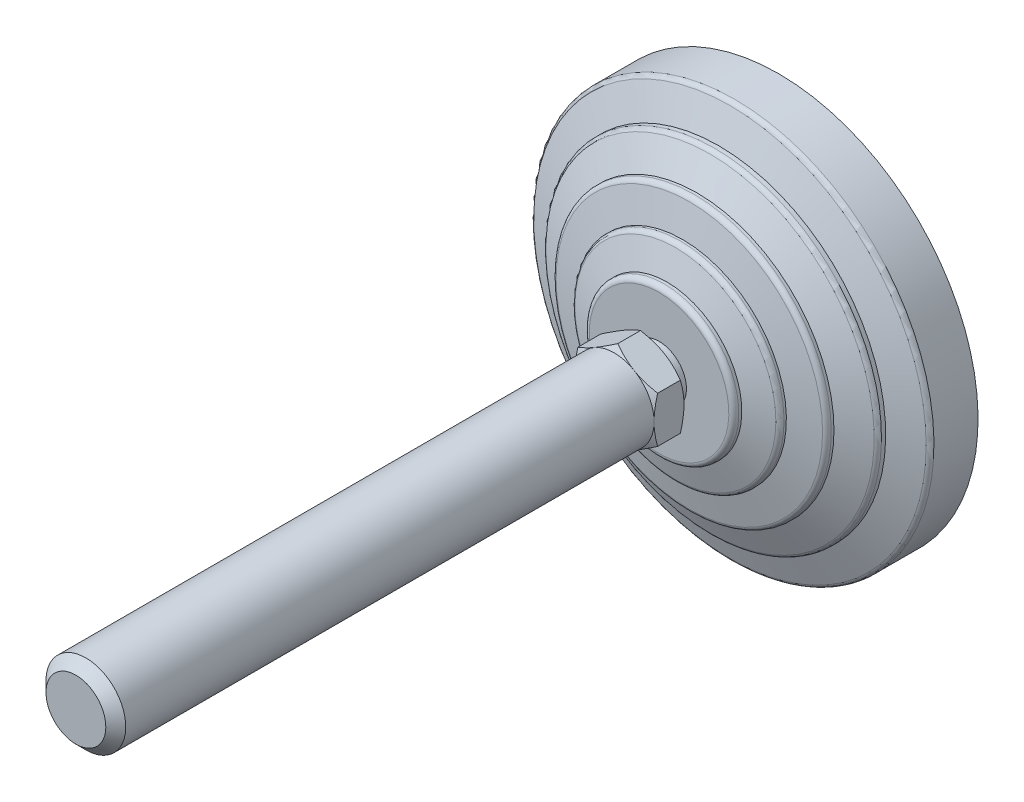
ISO-10303-21;
HEADER;
FILE_DESCRIPTION(('STEP AP214'),'2;1');
FILE_NAME('part.step','',(''),(''),'','','');
FILE_SCHEMA(('AUTOMOTIVE_DESIGN { 1 0 10303 214 1 1 1 1 }'));
ENDSEC;
DATA;
#1=APPLICATION_CONTEXT('core data for automotive mechanical design processes');
#2=APPLICATION_PROTOCOL_DEFINITION('international standard','automotive_design',2000,#1);
#3=PRODUCT_CONTEXT('',#1,'mechanical');
#4=PRODUCT('Part','Part','',(#3));
#5=PRODUCT_RELATED_PRODUCT_CATEGORY('part','',(#4));
#6=PRODUCT_DEFINITION_FORMATION('','',#4);
#7=PRODUCT_DEFINITION_CONTEXT('part definition',#1,'design');
#8=PRODUCT_DEFINITION('design','',#6,#7);
#9=PRODUCT_DEFINITION_SHAPE('','',#8);
#10=(LENGTH_UNIT() NAMED_UNIT(*) SI_UNIT(.MILLI.,.METRE.));
#11=(NAMED_UNIT(*) PLANE_ANGLE_UNIT() SI_UNIT($,.RADIAN.));
#12=(NAMED_UNIT(*) SI_UNIT($,.STERADIAN.) SOLID_ANGLE_UNIT());
#13=UNCERTAINTY_MEASURE_WITH_UNIT(LENGTH_MEASURE(1.E-05),#10,'distance_accuracy_value','');
#14=(GEOMETRIC_REPRESENTATION_CONTEXT(3) GLOBAL_UNCERTAINTY_ASSIGNED_CONTEXT((#13)) GLOBAL_UNIT_ASSIGNED_CONTEXT((#10,
#11,#12)) REPRESENTATION_CONTEXT('',''));
#15=CARTESIAN_POINT('',(0.,0.,0.));
#16=DIRECTION('',(0.,0.,1.));
#17=DIRECTION('',(1.,0.,0.));
#18=AXIS2_PLACEMENT_3D('',#15,#16,#17);
#19=CARTESIAN_POINT('',(-33.5,0.,3.));
#20=DIRECTION('',(0.,0.,1.));
#21=DIRECTION('',(0.,-1.,0.));
#22=AXIS2_PLACEMENT_3D('',#19,#20,#21);
#23=PLANE('',#22);
#24=CARTESIAN_POINT('',(0.,0.,3.));
#25=DIRECTION('',(0.,0.,-1.));
#26=DIRECTION('',(0.,1.,0.));
#27=AXIS2_PLACEMENT_3D('',#24,#25,#26);
#28=CIRCLE('',#27,33.5);
#29=CARTESIAN_POINT('',(0.,33.5,3.));
#30=VERTEX_POINT('',#29);
#31=EDGE_CURVE('E332',#30,#30,#28,.T.);
#32=ORIENTED_EDGE('',*,*,#31,.F.);
#33=EDGE_LOOP('',(#32));
#34=FACE_BOUND('',#33,.T.);
#35=CARTESIAN_POINT('',(0.,0.,3.));
#36=DIRECTION('',(0.,0.,-1.));
#37=DIRECTION('',(0.,1.,0.));
#38=AXIS2_PLACEMENT_3D('',#35,#36,#37);
#39=CIRCLE('',#38,40.);
#40=CARTESIAN_POINT('',(0.,40.,3.));
#41=VERTEX_POINT('',#40);
#42=EDGE_CURVE('E394',#41,#41,#39,.T.);
#43=ORIENTED_EDGE('',*,*,#42,.T.);
#44=EDGE_LOOP('',(#43));
#45=FACE_BOUND('',#44,.T.);
#46=ADVANCED_FACE('F14',(#34,#45),#23,.F.);
#47=CARTESIAN_POINT('',(0.,0.,0.));
#48=DIRECTION('',(0.,0.,-1.));
#49=DIRECTION('',(0.,1.,0.));
#50=AXIS2_PLACEMENT_3D('',#47,#48,#49);
#51=CYLINDRICAL_SURFACE('',#50,33.5);
#52=CARTESIAN_POINT('',(0.,0.,0.));
#53=DIRECTION('',(0.,0.,-1.));
#54=DIRECTION('',(0.,1.,0.));
#55=AXIS2_PLACEMENT_3D('',#52,#53,#54);
#56=CIRCLE('',#55,33.5);
#57=CARTESIAN_POINT('',(0.,33.5,0.));
#58=VERTEX_POINT('',#57);
#59=EDGE_CURVE('E329',#58,#58,#56,.T.);
#60=ORIENTED_EDGE('',*,*,#59,.F.);
#61=EDGE_LOOP('',(#60));
#62=FACE_BOUND('',#61,.T.);
#63=ORIENTED_EDGE('',*,*,#31,.T.);
#64=EDGE_LOOP('',(#63));
#65=FACE_BOUND('',#64,.T.);
#66=ADVANCED_FACE('F316',(#62,#65),#51,.T.);
#67=CARTESIAN_POINT('',(0.,0.,0.));
#68=DIRECTION('',(0.,0.,1.));
#69=DIRECTION('',(0.,-1.,0.));
#70=AXIS2_PLACEMENT_3D('',#67,#68,#69);
#71=PLANE('',#70);
#72=ORIENTED_EDGE('',*,*,#59,.T.);
#73=EDGE_LOOP('',(#72));
#74=FACE_BOUND('',#73,.T.);
#75=ADVANCED_FACE('F300',(#74),#71,.F.);
#76=CARTESIAN_POINT('',(-7.76470588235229,0.,30.));
#77=DIRECTION('',(0.,0.,1.));
#78=DIRECTION('',(0.,-1.,0.));
#79=AXIS2_PLACEMENT_3D('',#76,#77,#78);
#80=PLANE('',#79);
#81=CARTESIAN_POINT('',(0.,0.,30.));
#82=DIRECTION('',(0.,0.,-1.));
#83=DIRECTION('',(0.,1.,0.));
#84=AXIS2_PLACEMENT_3D('',#81,#82,#83);
#85=CIRCLE('',#84,5.5000000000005);
#86=CARTESIAN_POINT('',(0.,5.5000000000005,30.));
#87=VERTEX_POINT('',#86);
#88=EDGE_CURVE('E346',#87,#87,#85,.T.);
#89=ORIENTED_EDGE('',*,*,#88,.F.);
#90=EDGE_LOOP('',(#89));
#91=FACE_BOUND('',#90,.T.);
#92=CARTESIAN_POINT('',(0.,0.,30.));
#93=DIRECTION('',(0.,0.,-1.));
#94=DIRECTION('',(-1.,0.,0.));
#95=AXIS2_PLACEMENT_3D('',#92,#93,#94);
#96=CIRCLE('',#95,8.00000000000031);
#97=CARTESIAN_POINT('',(4.,6.92820323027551,30.));
#98=VERTEX_POINT('',#97);
#99=CARTESIAN_POINT('',(8.,0.,30.));
#100=VERTEX_POINT('',#99);
#101=EDGE_CURVE('E491',#98,#100,#96,.T.);
#102=ORIENTED_EDGE('',*,*,#101,.T.);
#103=CARTESIAN_POINT('',(4.,-6.92820323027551,30.));
#104=VERTEX_POINT('',#103);
#105=EDGE_CURVE('E140',#100,#104,#96,.T.);
#106=ORIENTED_EDGE('',*,*,#105,.T.);
#107=CARTESIAN_POINT('',(-4.,-6.92820323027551,30.));
#108=VERTEX_POINT('',#107);
#109=EDGE_CURVE('E139',#104,#108,#96,.T.);
#110=ORIENTED_EDGE('',*,*,#109,.T.);
#111=CARTESIAN_POINT('',(-8.,0.,30.));
#112=VERTEX_POINT('',#111);
#113=EDGE_CURVE('E116',#108,#112,#96,.T.);
#114=ORIENTED_EDGE('',*,*,#113,.T.);
#115=CARTESIAN_POINT('',(-4.,6.92820323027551,30.));
#116=VERTEX_POINT('',#115);
#117=EDGE_CURVE('E104',#112,#116,#96,.T.);
#118=ORIENTED_EDGE('',*,*,#117,.T.);
#119=EDGE_CURVE('E33',#116,#98,#96,.T.);
#120=ORIENTED_EDGE('',*,*,#119,.T.);
#121=EDGE_LOOP('',(#102,#106,#110,#114,#118,#120));
#122=FACE_BOUND('',#121,.T.);
#123=ADVANCED_FACE('F137',(#91,#122),#80,.F.);
#124=CARTESIAN_POINT('',(0.,0.,0.));
#125=DIRECTION('',(0.,0.,-1.));
#126=DIRECTION('',(0.,1.,0.));
#127=AXIS2_PLACEMENT_3D('',#124,#125,#126);
#128=CYLINDRICAL_SURFACE('',#127,5.5000000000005);
#129=CARTESIAN_POINT('',(0.,0.,27.));
#130=DIRECTION('',(0.,0.,-1.));
#131=DIRECTION('',(0.,1.,0.));
#132=AXIS2_PLACEMENT_3D('',#129,#130,#131);
#133=CIRCLE('',#132,5.5000000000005);
#134=CARTESIAN_POINT('',(0.,5.5000000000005,27.));
#135=VERTEX_POINT('',#134);
#136=EDGE_CURVE('E349',#135,#135,#133,.T.);
#137=ORIENTED_EDGE('',*,*,#136,.F.);
#138=EDGE_LOOP('',(#137));
#139=FACE_BOUND('',#138,.T.);
#140=ORIENTED_EDGE('',*,*,#88,.T.);
#141=EDGE_LOOP('',(#140));
#142=FACE_BOUND('',#141,.T.);
#143=ADVANCED_FACE('F293',(#139,#142),#128,.T.);
#144=CARTESIAN_POINT('',(-5.5000000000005,0.,27.));
#145=DIRECTION('',(0.,0.,-1.));
#146=DIRECTION('',(0.,1.,0.));
#147=AXIS2_PLACEMENT_3D('',#144,#145,#146);
#148=PLANE('',#147);
#149=CARTESIAN_POINT('',(0.,0.,27.));
#150=DIRECTION('',(0.,0.,-1.));
#151=DIRECTION('',(0.,1.,0.));
#152=AXIS2_PLACEMENT_3D('',#149,#150,#151);
#153=CIRCLE('',#152,13.9999999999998);
#154=CARTESIAN_POINT('',(0.,13.9999999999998,27.));
#155=VERTEX_POINT('',#154);
#156=EDGE_CURVE('E352',#155,#155,#153,.T.);
#157=ORIENTED_EDGE('',*,*,#156,.F.);
#158=EDGE_LOOP('',(#157));
#159=FACE_BOUND('',#158,.T.);
#160=ORIENTED_EDGE('',*,*,#136,.T.);
#161=EDGE_LOOP('',(#160));
#162=FACE_BOUND('',#161,.T.);
#163=ADVANCED_FACE('F289',(#159,#162),#148,.F.);
#164=CARTESIAN_POINT('',(0.,0.,26.));
#165=DIRECTION('',(0.,0.,-1.));
#166=DIRECTION('',(0.,1.,0.));
#167=AXIS2_PLACEMENT_3D('',#164,#165,#166);
#168=TOROIDAL_SURFACE('',#167,13.9999999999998,1.);
#169=CARTESIAN_POINT('',(0.,0.,26.));
#170=DIRECTION('',(0.,0.,-1.));
#171=DIRECTION('',(0.,1.,0.));
#172=AXIS2_PLACEMENT_3D('',#169,#170,#171);
#173=CIRCLE('',#172,14.9999999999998);
#174=CARTESIAN_POINT('',(0.,14.9999999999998,26.));
#175=VERTEX_POINT('',#174);
#176=EDGE_CURVE('E355',#175,#175,#173,.T.);
#177=ORIENTED_EDGE('',*,*,#176,.F.);
#178=EDGE_LOOP('',(#177));
#179=FACE_BOUND('',#178,.T.);
#180=ORIENTED_EDGE('',*,*,#156,.T.);
#181=EDGE_LOOP('',(#180));
#182=FACE_BOUND('',#181,.T.);
#183=ADVANCED_FACE('F285',(#179,#182),#168,.T.);
#184=CARTESIAN_POINT('',(0.,0.,0.));
#185=DIRECTION('',(0.,0.,-1.));
#186=DIRECTION('',(0.,1.,0.));
#187=AXIS2_PLACEMENT_3D('',#184,#185,#186);
#188=CYLINDRICAL_SURFACE('',#187,14.9999999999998);
#189=CARTESIAN_POINT('',(0.,0.,25.4025287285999));
#190=DIRECTION('',(0.,0.,-1.));
#191=DIRECTION('',(0.,1.,0.));
#192=AXIS2_PLACEMENT_3D('',#189,#190,#191);
#193=CIRCLE('',#192,14.9999999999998);
#194=CARTESIAN_POINT('',(0.,14.9999999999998,25.4025287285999));
#195=VERTEX_POINT('',#194);
#196=EDGE_CURVE('E358',#195,#195,#193,.T.);
#197=ORIENTED_EDGE('',*,*,#196,.F.);
#198=EDGE_LOOP('',(#197));
#199=FACE_BOUND('',#198,.T.);
#200=ORIENTED_EDGE('',*,*,#176,.T.);
#201=EDGE_LOOP('',(#200));
#202=FACE_BOUND('',#201,.T.);
#203=ADVANCED_FACE('F281',(#199,#202),#188,.T.);
#204=CARTESIAN_POINT('',(0.,0.,25.4025287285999));
#205=DIRECTION('',(0.,0.,-1.));
#206=DIRECTION('',(0.,1.,0.));
#207=AXIS2_PLACEMENT_3D('',#204,#205,#206);
#208=CONICAL_SURFACE('',#207,14.9999999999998,1.25589726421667);
#209=CARTESIAN_POINT('',(0.,0.,23.7216684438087));
#210=DIRECTION('',(0.,0.,-1.));
#211=DIRECTION('',(0.,1.,0.));
#212=AXIS2_PLACEMENT_3D('',#209,#210,#211);
#213=CIRCLE('',#212,20.1601635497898);
#214=CARTESIAN_POINT('',(0.,20.1601635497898,23.7216684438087));
#215=VERTEX_POINT('',#214);
#216=EDGE_CURVE('E361',#215,#215,#213,.T.);
#217=ORIENTED_EDGE('',*,*,#216,.F.);
#218=EDGE_LOOP('',(#217));
#219=FACE_BOUND('',#218,.T.);
#220=ORIENTED_EDGE('',*,*,#196,.T.);
#221=EDGE_LOOP('',(#220));
#222=FACE_BOUND('',#221,.T.);
#223=ADVANCED_FACE('F277',(#219,#222),#208,.T.);
#224=CARTESIAN_POINT('',(0.,0.,22.7708407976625));
#225=DIRECTION('',(0.,0.,-1.));
#226=DIRECTION('',(0.,1.,0.));
#227=AXIS2_PLACEMENT_3D('',#224,#225,#226);
#228=TOROIDAL_SURFACE('',#227,19.8504430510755,1.);
#229=CARTESIAN_POINT('',(0.,0.,22.7708407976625));
#230=DIRECTION('',(0.,0.,-1.));
#231=DIRECTION('',(0.,1.,0.));
#232=AXIS2_PLACEMENT_3D('',#229,#230,#231);
#233=CIRCLE('',#232,20.8504430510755);
#234=CARTESIAN_POINT('',(0.,20.8504430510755,22.7708407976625));
#235=VERTEX_POINT('',#234);
#236=EDGE_CURVE('E364',#235,#235,#233,.T.);
#237=ORIENTED_EDGE('',*,*,#236,.F.);
#238=EDGE_LOOP('',(#237));
#239=FACE_BOUND('',#238,.T.);
#240=ORIENTED_EDGE('',*,*,#216,.T.);
#241=EDGE_LOOP('',(#240));
#242=FACE_BOUND('',#241,.T.);
#243=ADVANCED_FACE('F273',(#239,#242),#228,.T.);
#244=CARTESIAN_POINT('',(0.,0.,0.));
#245=DIRECTION('',(0.,0.,-1.));
#246=DIRECTION('',(0.,1.,0.));
#247=AXIS2_PLACEMENT_3D('',#244,#245,#246);
#248=CYLINDRICAL_SURFACE('',#247,20.8504430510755);
#249=CARTESIAN_POINT('',(0.,0.,22.2987385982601));
#250=DIRECTION('',(0.,0.,-1.));
#251=DIRECTION('',(0.,1.,0.));
#252=AXIS2_PLACEMENT_3D('',#249,#250,#251);
#253=CIRCLE('',#252,20.8504430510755);
#254=CARTESIAN_POINT('',(0.,20.8504430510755,22.2987385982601));
#255=VERTEX_POINT('',#254);
#256=EDGE_CURVE('E367',#255,#255,#253,.T.);
#257=ORIENTED_EDGE('',*,*,#256,.F.);
#258=EDGE_LOOP('',(#257));
#259=FACE_BOUND('',#258,.T.);
#260=ORIENTED_EDGE('',*,*,#236,.T.);
#261=EDGE_LOOP('',(#260));
#262=FACE_BOUND('',#261,.T.);
#263=ADVANCED_FACE('F269',(#259,#262),#248,.T.);
#264=CARTESIAN_POINT('',(0.,0.,22.2987385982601));
#265=DIRECTION('',(0.,0.,-1.));
#266=DIRECTION('',(0.,1.,0.));
#267=AXIS2_PLACEMENT_3D('',#264,#265,#266);
#268=CONICAL_SURFACE('',#267,20.8504430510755,1.34067144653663);
#269=CARTESIAN_POINT('',(0.,0.,20.9217501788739));
#270=DIRECTION('',(0.,0.,-1.));
#271=DIRECTION('',(0.,1.,0.));
#272=AXIS2_PLACEMENT_3D('',#269,#270,#271);
#273=CIRCLE('',#272,26.7280991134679);
#274=CARTESIAN_POINT('',(0.,26.7280991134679,20.9217501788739));
#275=VERTEX_POINT('',#274);
#276=EDGE_CURVE('E370',#275,#275,#273,.T.);
#277=ORIENTED_EDGE('',*,*,#276,.F.);
#278=EDGE_LOOP('',(#277));
#279=FACE_BOUND('',#278,.T.);
#280=ORIENTED_EDGE('',*,*,#256,.T.);
#281=EDGE_LOOP('',(#280));
#282=FACE_BOUND('',#281,.T.);
#283=ADVANCED_FACE('F265',(#279,#282),#268,.T.);
#284=CARTESIAN_POINT('',(0.,0.,19.9481122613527));
#285=DIRECTION('',(0.,0.,-1.));
#286=DIRECTION('',(0.,1.,0.));
#287=AXIS2_PLACEMENT_3D('',#284,#285,#286);
#288=TOROIDAL_SURFACE('',#287,26.5,1.00000000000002);
#289=CARTESIAN_POINT('',(0.,0.,19.9481122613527));
#290=DIRECTION('',(0.,0.,-1.));
#291=DIRECTION('',(0.,1.,0.));
#292=AXIS2_PLACEMENT_3D('',#289,#290,#291);
#293=CIRCLE('',#292,27.5);
#294=CARTESIAN_POINT('',(0.,27.5,19.9481122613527));
#295=VERTEX_POINT('',#294);
#296=EDGE_CURVE('E373',#295,#295,#293,.T.);
#297=ORIENTED_EDGE('',*,*,#296,.F.);
#298=EDGE_LOOP('',(#297));
#299=FACE_BOUND('',#298,.T.);
#300=ORIENTED_EDGE('',*,*,#276,.T.);
#301=EDGE_LOOP('',(#300));
#302=FACE_BOUND('',#301,.T.);
#303=ADVANCED_FACE('F261',(#299,#302),#288,.T.);
#304=CARTESIAN_POINT('',(0.,0.,0.));
#305=DIRECTION('',(0.,0.,-1.));
#306=DIRECTION('',(0.,1.,0.));
#307=AXIS2_PLACEMENT_3D('',#304,#305,#306);
#308=CYLINDRICAL_SURFACE('',#307,27.5);
#309=CARTESIAN_POINT('',(0.,0.,19.4025287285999));
#310=DIRECTION('',(0.,0.,-1.));
#311=DIRECTION('',(0.,1.,0.));
#312=AXIS2_PLACEMENT_3D('',#309,#310,#311);
#313=CIRCLE('',#312,27.5);
#314=CARTESIAN_POINT('',(0.,27.5,19.4025287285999));
#315=VERTEX_POINT('',#314);
#316=EDGE_CURVE('E376',#315,#315,#313,.T.);
#317=ORIENTED_EDGE('',*,*,#316,.F.);
#318=EDGE_LOOP('',(#317));
#319=FACE_BOUND('',#318,.T.);
#320=ORIENTED_EDGE('',*,*,#296,.T.);
#321=EDGE_LOOP('',(#320));
#322=FACE_BOUND('',#321,.T.);
#323=ADVANCED_FACE('F257',(#319,#322),#308,.T.);
#324=CARTESIAN_POINT('',(0.,0.,19.4025287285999));
#325=DIRECTION('',(0.,0.,-1.));
#326=DIRECTION('',(0.,1.,0.));
#327=AXIS2_PLACEMENT_3D('',#324,#325,#326);
#328=CONICAL_SURFACE('',#327,27.5,1.1202291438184);
#329=CARTESIAN_POINT('',(0.,0.,16.7730910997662));
#330=DIRECTION('',(0.,0.,-1.));
#331=DIRECTION('',(0.,1.,0.));
#332=AXIS2_PLACEMENT_3D('',#329,#330,#331);
#333=CIRCLE('',#332,32.935476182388);
#334=CARTESIAN_POINT('',(0.,32.935476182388,16.7730910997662));
#335=VERTEX_POINT('',#334);
#336=EDGE_CURVE('E379',#335,#335,#333,.T.);
#337=ORIENTED_EDGE('',*,*,#336,.F.);
#338=EDGE_LOOP('',(#337));
#339=FACE_BOUND('',#338,.T.);
#340=ORIENTED_EDGE('',*,*,#316,.T.);
#341=EDGE_LOOP('',(#340));
#342=FACE_BOUND('',#341,.T.);
#343=ADVANCED_FACE('F253',(#339,#342),#328,.T.);
#344=CARTESIAN_POINT('',(0.,0.,15.8728908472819));
#345=DIRECTION('',(0.,0.,-1.));
#346=DIRECTION('',(0.,1.,0.));
#347=AXIS2_PLACEMENT_3D('',#344,#345,#346);
#348=TOROIDAL_SURFACE('',#347,32.5,0.999999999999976);
#349=CARTESIAN_POINT('',(0.,0.,15.8728908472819));
#350=DIRECTION('',(0.,0.,-1.));
#351=DIRECTION('',(0.,1.,0.));
#352=AXIS2_PLACEMENT_3D('',#349,#350,#351);
#353=CIRCLE('',#352,33.5);
#354=CARTESIAN_POINT('',(0.,33.5,15.8728908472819));
#355=VERTEX_POINT('',#354);
#356=EDGE_CURVE('E382',#355,#355,#353,.T.);
#357=ORIENTED_EDGE('',*,*,#356,.F.);
#358=EDGE_LOOP('',(#357));
#359=FACE_BOUND('',#358,.T.);
#360=ORIENTED_EDGE('',*,*,#336,.T.);
#361=EDGE_LOOP('',(#360));
#362=FACE_BOUND('',#361,.T.);
#363=ADVANCED_FACE('F249',(#359,#362),#348,.T.);
#364=CARTESIAN_POINT('',(0.,0.,0.));
#365=DIRECTION('',(0.,0.,-1.));
#366=DIRECTION('',(0.,1.,0.));
#367=AXIS2_PLACEMENT_3D('',#364,#365,#366);
#368=CYLINDRICAL_SURFACE('',#367,33.5);
#369=CARTESIAN_POINT('',(0.,0.,15.0315037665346));
#370=DIRECTION('',(0.,0.,-1.));
#371=DIRECTION('',(0.,1.,0.));
#372=AXIS2_PLACEMENT_3D('',#369,#370,#371);
#373=CIRCLE('',#372,33.5);
#374=CARTESIAN_POINT('',(0.,33.5,15.0315037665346));
#375=VERTEX_POINT('',#374);
#376=EDGE_CURVE('E385',#375,#375,#373,.T.);
#377=ORIENTED_EDGE('',*,*,#376,.F.);
#378=EDGE_LOOP('',(#377));
#379=FACE_BOUND('',#378,.T.);
#380=ORIENTED_EDGE('',*,*,#356,.T.);
#381=EDGE_LOOP('',(#380));
#382=FACE_BOUND('',#381,.T.);
#383=ADVANCED_FACE('F245',(#379,#382),#368,.T.);
#384=CARTESIAN_POINT('',(0.,0.,15.0315037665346));
#385=DIRECTION('',(0.,0.,-1.));
#386=DIRECTION('',(0.,1.,0.));
#387=AXIS2_PLACEMENT_3D('',#384,#385,#386);
#388=CONICAL_SURFACE('',#387,33.5,1.20362249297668);
#389=CARTESIAN_POINT('',(0.,0.,12.7780502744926));
#390=DIRECTION('',(0.,0.,-1.));
#391=DIRECTION('',(0.,1.,0.));
#392=AXIS2_PLACEMENT_3D('',#389,#390,#391);
#393=CIRCLE('',#392,39.3589790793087);
#394=CARTESIAN_POINT('',(0.,39.3589790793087,12.7780502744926));
#395=VERTEX_POINT('',#394);
#396=EDGE_CURVE('E388',#395,#395,#393,.T.);
#397=ORIENTED_EDGE('',*,*,#396,.F.);
#398=EDGE_LOOP('',(#397));
#399=FACE_BOUND('',#398,.T.);
#400=ORIENTED_EDGE('',*,*,#376,.T.);
#401=EDGE_LOOP('',(#400));
#402=FACE_BOUND('',#401,.T.);
#403=ADVANCED_FACE('F241',(#399,#402),#388,.T.);
#404=CARTESIAN_POINT('',(0.,0.,11.8447046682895));
#405=DIRECTION('',(0.,0.,-1.));
#406=DIRECTION('',(0.,1.,0.));
#407=AXIS2_PLACEMENT_3D('',#404,#405,#406);
#408=TOROIDAL_SURFACE('',#407,39.,1.00000000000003);
#409=CARTESIAN_POINT('',(0.,0.,11.8447046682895));
#410=DIRECTION('',(0.,0.,-1.));
#411=DIRECTION('',(0.,1.,0.));
#412=AXIS2_PLACEMENT_3D('',#409,#410,#411);
#413=CIRCLE('',#412,40.);
#414=CARTESIAN_POINT('',(0.,40.,11.8447046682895));
#415=VERTEX_POINT('',#414);
#416=EDGE_CURVE('E391',#415,#415,#413,.T.);
#417=ORIENTED_EDGE('',*,*,#416,.F.);
#418=EDGE_LOOP('',(#417));
#419=FACE_BOUND('',#418,.T.);
#420=ORIENTED_EDGE('',*,*,#396,.T.);
#421=EDGE_LOOP('',(#420));
#422=FACE_BOUND('',#421,.T.);
#423=ADVANCED_FACE('F237',(#419,#422),#408,.T.);
#424=CARTESIAN_POINT('',(0.,0.,0.));
#425=DIRECTION('',(0.,0.,-1.));
#426=DIRECTION('',(0.,1.,0.));
#427=AXIS2_PLACEMENT_3D('',#424,#425,#426);
#428=CYLINDRICAL_SURFACE('',#427,40.);
#429=ORIENTED_EDGE('',*,*,#42,.F.);
#430=EDGE_LOOP('',(#429));
#431=FACE_BOUND('',#430,.T.);
#432=ORIENTED_EDGE('',*,*,#416,.T.);
#433=EDGE_LOOP('',(#432));
#434=FACE_BOUND('',#433,.T.);
#435=ADVANCED_FACE('F233',(#431,#434),#428,.T.);
#436=CARTESIAN_POINT('',(0.,0.,31.5569542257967));
#437=DIRECTION('',(0.,0.,1.));
#438=DIRECTION('',(1.,0.,0.));
#439=AXIS2_PLACEMENT_3D('',#436,#437,#438);
#440=CONICAL_SURFACE('',#439,10.6967238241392,1.04719755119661);
#441=CARTESIAN_POINT('',(8.,-12.3669762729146,33.8849637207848));
#442=CARTESIAN_POINT('',(8.,-12.0179004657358,33.715790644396));
#443=CARTESIAN_POINT('',(8.,-11.6680190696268,33.5482511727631));
#444=CARTESIAN_POINT('',(8.,-10.9662165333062,33.2173590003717));
#445=CARTESIAN_POINT('',(8.,-10.61429507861,33.0540069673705));
#446=CARTESIAN_POINT('',(8.,-9.90615147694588,32.7315788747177));
#447=CARTESIAN_POINT('',(8.,-9.54991632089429,32.5725312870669));
#448=CARTESIAN_POINT('',(8.,-8.83459883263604,32.2609979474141));
#449=CARTESIAN_POINT('',(8.,-8.47551663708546,32.1085118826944));
#450=CARTESIAN_POINT('',(8.,-7.74248496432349,31.8071281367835));
#451=CARTESIAN_POINT('',(8.,-7.36842507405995,31.6584975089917));
#452=CARTESIAN_POINT('',(8.,-6.61591527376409,31.3725815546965));
#453=CARTESIAN_POINT('',(8.,-6.23746487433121,31.2352975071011));
#454=CARTESIAN_POINT('',(8.,-5.47628871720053,30.9757083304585));
#455=CARTESIAN_POINT('',(8.,-5.09357353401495,30.8533725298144));
#456=CARTESIAN_POINT('',(8.,-4.32266739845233,30.6276299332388));
#457=CARTESIAN_POINT('',(8.,-3.93447822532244,30.5242171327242));
#458=CARTESIAN_POINT('',(8.,-3.15449256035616,30.3418659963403));
#459=CARTESIAN_POINT('',(8.,-2.76272769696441,30.2627960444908));
#460=CARTESIAN_POINT('',(8.,-2.17154476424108,30.1658897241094));
#461=CARTESIAN_POINT('',(8.,-1.9738796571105,30.1372027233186));
#462=CARTESIAN_POINT('',(8.,-1.57758050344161,30.0876251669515));
#463=CARTESIAN_POINT('',(8.,-1.37894655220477,30.0667338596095));
#464=CARTESIAN_POINT('',(8.,-0.9835528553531,30.0334238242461));
#465=CARTESIAN_POINT('',(8.,-0.786802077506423,30.0208990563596));
#466=CARTESIAN_POINT('',(8.,-0.392947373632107,30.0041781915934));
#467=CARTESIAN_POINT('',(8.,-0.195843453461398,29.9999819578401));
#468=CARTESIAN_POINT('',(8.,0.198365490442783,30.0000181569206));
#469=CARTESIAN_POINT('',(8.,0.395470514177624,30.0042506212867));
#470=CARTESIAN_POINT('',(8.,0.789328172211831,30.021041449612));
#471=CARTESIAN_POINT('',(8.,0.986080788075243,30.0336002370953));
#472=CARTESIAN_POINT('',(8.,1.46015925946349,30.0736278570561));
#473=CARTESIAN_POINT('',(8.,1.73715285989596,30.1051151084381));
#474=CARTESIAN_POINT('',(8.,2.28904490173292,30.1828648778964));
#475=CARTESIAN_POINT('',(8.,2.56394304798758,30.2291294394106));
#476=CARTESIAN_POINT('',(8.,3.38520299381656,30.387632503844));
#477=CARTESIAN_POINT('',(8.,3.92781475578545,30.5195502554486));
#478=CARTESIAN_POINT('',(8.,4.73908649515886,30.747807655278));
#479=CARTESIAN_POINT('',(8.,5.01196745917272,30.8300037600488));
#480=CARTESIAN_POINT('',(8.,5.55507825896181,31.0028097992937));
#481=CARTESIAN_POINT('',(8.,5.82530807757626,31.093419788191));
#482=CARTESIAN_POINT('',(8.,6.36320372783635,31.2816101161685));
#483=CARTESIAN_POINT('',(8.,6.63087040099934,31.3791880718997));
#484=CARTESIAN_POINT('',(8.,7.16399467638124,31.5801785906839));
#485=CARTESIAN_POINT('',(8.,7.42945230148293,31.6835910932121));
#486=CARTESIAN_POINT('',(8.,8.04333492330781,31.9292696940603));
#487=CARTESIAN_POINT('',(8.,8.39103245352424,32.0733498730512));
#488=CARTESIAN_POINT('',(8.,9.08356712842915,32.3682469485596));
#489=CARTESIAN_POINT('',(8.,9.42840411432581,32.5190642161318));
#490=CARTESIAN_POINT('',(8.,10.1157266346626,32.826118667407));
#491=CARTESIAN_POINT('',(8.,10.4582117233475,32.9823568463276));
#492=CARTESIAN_POINT('',(8.,11.1411605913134,33.2991978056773));
#493=CARTESIAN_POINT('',(8.,11.481624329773,33.4598006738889));
#494=CARTESIAN_POINT('',(8.,12.1611860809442,33.7847316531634));
#495=CARTESIAN_POINT('',(8.,12.5002823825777,33.9490633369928));
#496=CARTESIAN_POINT('',(8.,13.1770305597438,34.2806771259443));
#497=CARTESIAN_POINT('',(8.,13.5146824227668,34.4479592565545));
#498=CARTESIAN_POINT('',(8.,14.5257253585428,34.9534236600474));
#499=CARTESIAN_POINT('',(8.,15.1972873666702,35.2952642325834));
#500=CARTESIAN_POINT('',(8.,16.4826971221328,35.9579484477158));
#501=CARTESIAN_POINT('',(8.,17.0968224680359,36.2782559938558));
#502=CARTESIAN_POINT('',(8.,18.3227678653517,36.9232972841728));
#503=CARTESIAN_POINT('',(8.,18.9345878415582,37.2480311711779));
#504=CARTESIAN_POINT('',(8.,20.1549782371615,37.900112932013));
#505=CARTESIAN_POINT('',(8.,20.7635529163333,38.2274528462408));
#506=CARTESIAN_POINT('',(8.,21.9792203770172,38.8847984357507));
#507=CARTESIAN_POINT('',(8.,22.5863132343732,39.2148039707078));
#508=CARTESIAN_POINT('',(8.,23.1928570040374,39.5458088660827));
#509=B_SPLINE_CURVE_WITH_KNOTS('',3,(#441,#442,#443,#444,#445,#446,#447,#448,#449,#450,#451,
#452,#453,#454,#455,#456,#457,#458,#459,#460,#461,#462,#463,#464,#465,#466,#467,#468,#469,#470,
#471,#472,#473,#474,#475,#476,#477,#478,#479,#480,#481,#482,#483,#484,#485,#486,#487,#488,#489,
#490,#491,#492,#493,#494,#495,#496,#497,#498,#499,#500,#501,#502,#503,#504,#505,#506,#507,#508),
.UNSPECIFIED.,.F.,.F.,(4,2,2,2,2,2,2,2,2,2,2,2,2,2,2,2,2,2,2,2,2,2,2,2,2,2,2,2,2,2,2,2,2,4),(0.,
1.16374161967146,2.32766767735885,3.49799777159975,4.66827202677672,5.87565014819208,
7.08316417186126,8.2881573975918,9.49276759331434,10.690745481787,11.2898236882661,
11.8888441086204,12.4801205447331,13.0713872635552,13.66265619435,14.2539552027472,
15.0898145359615,15.9257895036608,17.5986861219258,18.4535912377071,19.3085018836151,
20.16312150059,21.0177322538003,22.1467411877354,23.2758123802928,24.4050919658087,
25.5343942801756,26.6648285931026,27.7952726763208,30.0558824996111,32.1337760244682,
34.2117367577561,36.2848025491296,38.357759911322),.UNSPECIFIED.);
#510=CARTESIAN_POINT('',(8.,4.61880215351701,30.7145311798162));
#511=VERTEX_POINT('',#510);
#512=EDGE_CURVE('E114',#511,#100,#509,.F.);
#513=ORIENTED_EDGE('',*,*,#512,.T.);
#514=ORIENTED_EDGE('',*,*,#101,.F.);
#515=CARTESIAN_POINT('',(-1.08028203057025,9.86130542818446,31.1086857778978));
#516=CARTESIAN_POINT('',(-0.883522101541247,9.74770603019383,31.0311371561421));
#517=CARTESIAN_POINT('',(-0.685974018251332,9.63365159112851,30.9561718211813));
#518=CARTESIAN_POINT('',(-0.289142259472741,9.4045406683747,30.8123375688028));
#519=CARTESIAN_POINT('',(-0.0898579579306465,9.2894838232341,30.7434709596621));
#520=CARTESIAN_POINT('',(0.311291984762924,9.05787979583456,30.6125515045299));
#521=CARTESIAN_POINT('',(0.513164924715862,8.94132839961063,30.5505282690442));
#522=CARTESIAN_POINT('',(0.918666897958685,8.70721172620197,30.4347357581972));
#523=CARTESIAN_POINT('',(1.12229574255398,8.5896465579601,30.3809656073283));
#524=CARTESIAN_POINT('',(1.52492315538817,8.35718951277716,30.2843416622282));
#525=CARTESIAN_POINT('',(1.72386981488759,8.2423276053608,30.2412013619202));
#526=CARTESIAN_POINT('',(2.12317476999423,8.01178878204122,30.1647768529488));
#527=CARTESIAN_POINT('',(2.32353296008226,7.89611192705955,30.1314919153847));
#528=CARTESIAN_POINT('',(2.72500275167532,7.6643232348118,30.0757410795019));
#529=CARTESIAN_POINT('',(2.92611222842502,7.54821262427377,30.0532549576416));
#530=CARTESIAN_POINT('',(3.32904579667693,7.31557882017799,30.0196956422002));
#531=CARTESIAN_POINT('',(3.53086986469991,7.19905564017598,30.0086220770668));
#532=CARTESIAN_POINT('',(3.92256007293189,6.97291319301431,29.9985581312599));
#533=CARTESIAN_POINT('',(4.11241306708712,6.86330151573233,29.9988790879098));
#534=CARTESIAN_POINT('',(4.49189168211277,6.64420943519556,30.0099017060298));
#535=CARTESIAN_POINT('',(4.68151730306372,6.53472903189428,30.0206033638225));
#536=CARTESIAN_POINT('',(5.06044052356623,6.31595760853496,30.0521072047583));
#537=CARTESIAN_POINT('',(5.249737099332,6.20666717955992,30.0729256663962));
#538=CARTESIAN_POINT('',(5.62734960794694,5.98865249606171,30.1241019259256));
#539=CARTESIAN_POINT('',(5.81566555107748,5.8799282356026,30.1544596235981));
#540=CARTESIAN_POINT('',(6.38983571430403,5.5484309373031,30.2607979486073));
#541=CARTESIAN_POINT('',(6.77370069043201,5.32680639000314,30.3510486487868));
#542=CARTESIAN_POINT('',(7.53412004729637,4.8877780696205,30.5610838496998));
#543=CARTESIAN_POINT('',(7.91069357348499,4.67036324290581,30.6807748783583));
#544=CARTESIAN_POINT('',(8.28377704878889,4.45496339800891,30.8115956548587));
#545=B_SPLINE_CURVE_WITH_KNOTS('',3,(#515,#516,#517,#518,#519,#520,#521,#522,#523,#524,#525,
#526,#527,#528,#529,#530,#531,#532,#533,#534,#535,#536,#537,#538,#539,#540,#541,#542,#543,#544),
.UNSPECIFIED.,.F.,.F.,(4,2,2,2,2,2,2,2,2,2,2,2,2,2,4),(0.,0.720231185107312,1.44073381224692,
2.1642408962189,2.88767117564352,3.58869685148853,4.28967066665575,4.98932655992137,
5.68895967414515,6.3463846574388,7.00380940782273,7.66229551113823,8.32077469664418,
9.67654908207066,11.0280732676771),.UNSPECIFIED.);
#546=EDGE_CURVE('E17',#98,#511,#545,.T.);
#547=ORIENTED_EDGE('',*,*,#546,.T.);
#548=EDGE_LOOP('',(#513,#514,#547));
#549=FACE_BOUND('',#548,.T.);
#550=ADVANCED_FACE('F157',(#549),#440,.T.);
#551=CARTESIAN_POINT('',(-14.4856669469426,0.874300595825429,33.7597209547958));
#552=CARTESIAN_POINT('',(-14.1796291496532,1.05099160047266,33.5895491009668));
#553=CARTESIAN_POINT('',(-13.872847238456,1.22811221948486,33.4211275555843));
#554=CARTESIAN_POINT('',(-13.2573862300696,1.58344879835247,33.0888017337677));
#555=CARTESIAN_POINT('',(-12.9487067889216,1.76166495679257,32.9248983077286));
#556=CARTESIAN_POINT('',(-12.327223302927,2.12047861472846,32.6016846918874));
#557=CARTESIAN_POINT('',(-12.014405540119,2.30108403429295,32.442409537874));
#558=CARTESIAN_POINT('',(-11.3861154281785,2.663827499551,32.131029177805));
#559=CARTESIAN_POINT('',(-11.0706432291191,2.84596545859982,31.9789235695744));
#560=CARTESIAN_POINT('',(-10.4335430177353,3.21379543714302,31.6824478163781));
#561=CARTESIAN_POINT('',(-10.1118850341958,3.39950476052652,31.538163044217));
#562=CARTESIAN_POINT('',(-9.46467246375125,3.77317311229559,31.2615207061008));
#563=CARTESIAN_POINT('',(-9.1391174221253,3.96113240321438,31.1291645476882));
#564=CARTESIAN_POINT('',(-8.48433739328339,4.33916982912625,30.8801740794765));
#565=CARTESIAN_POINT('',(-8.15512298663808,4.52924185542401,30.7635030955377));
#566=CARTESIAN_POINT('',(-7.49198727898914,4.91210343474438,30.549896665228));
#567=CARTESIAN_POINT('',(-7.15806762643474,5.10489203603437,30.4529544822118));
#568=CARTESIAN_POINT('',(-6.48919721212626,5.49106454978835,30.2847792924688));
#569=CARTESIAN_POINT('',(-6.15430002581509,5.68441753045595,30.2132701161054));
#570=CARTESIAN_POINT('',(-5.64919291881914,5.97604125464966,30.1278100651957));
#571=CARTESIAN_POINT('',(-5.48034156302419,6.0735276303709,30.10295552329));
#572=CARTESIAN_POINT('',(-5.14192266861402,6.26891387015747,30.0610066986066));
#573=CARTESIAN_POINT('',(-4.97235519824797,6.36681369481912,30.0439116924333));
#574=CARTESIAN_POINT('',(-4.63370149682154,6.56233550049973,30.0179324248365));
#575=CARTESIAN_POINT('',(-4.46461788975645,6.65995596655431,30.0090027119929));
#576=CARTESIAN_POINT('',(-4.12627591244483,6.85529779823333,29.9993928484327));
#577=CARTESIAN_POINT('',(-3.95701754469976,6.95301916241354,29.9987125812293));
#578=CARTESIAN_POINT('',(-3.61867010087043,7.14836415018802,30.0056175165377));
#579=CARTESIAN_POINT('',(-3.44958099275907,7.24598779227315,30.0132006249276));
#580=CARTESIAN_POINT('',(-3.11181760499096,7.44099557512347,30.0364521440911));
#581=CARTESIAN_POINT('',(-2.94314335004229,7.53837970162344,30.0521210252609));
#582=CARTESIAN_POINT('',(-2.52743826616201,7.77838714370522,30.1003862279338));
#583=CARTESIAN_POINT('',(-2.28079173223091,7.92078858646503,30.1374758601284));
#584=CARTESIAN_POINT('',(-1.78957633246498,8.20439192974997,30.2268179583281));
#585=CARTESIAN_POINT('',(-1.54500781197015,8.34559363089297,30.2790728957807));
#586=CARTESIAN_POINT('',(-0.81391945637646,8.76768768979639,30.4559444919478));
#587=CARTESIAN_POINT('',(-0.330990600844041,9.04650679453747,30.600540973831));
#588=CARTESIAN_POINT('',(0.391001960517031,9.46334939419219,30.84774415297));
#589=CARTESIAN_POINT('',(0.633879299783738,9.60357469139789,30.9363260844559));
#590=CARTESIAN_POINT('',(1.11728873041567,9.88267125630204,31.1217969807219));
#591=CARTESIAN_POINT('',(1.35782061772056,10.0215424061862,31.218686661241));
#592=CARTESIAN_POINT('',(1.8353328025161,10.2972341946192,31.4187376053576));
#593=CARTESIAN_POINT('',(2.07232557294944,10.4340620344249,31.5218595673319));
#594=CARTESIAN_POINT('',(2.5443288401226,10.7065732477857,31.7337337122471));
#595=CARTESIAN_POINT('',(2.77933997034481,10.8422569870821,31.8424840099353));
#596=CARTESIAN_POINT('',(3.01352222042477,10.9774621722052,31.9535133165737));
#597=B_SPLINE_CURVE_WITH_KNOTS('',3,(#551,#552,#553,#554,#555,#556,#557,#558,#559,#560,#561,
#562,#563,#564,#565,#566,#567,#568,#569,#570,#571,#572,#573,#574,#575,#576,#577,#578,#579,#580,
#581,#582,#583,#584,#585,#586,#587,#588,#589,#590,#591,#592,#593,#594,#595,#596),.UNSPECIFIED.,
.F.,.F.,(4,2,2,2,2,2,2,2,2,2,2,2,2,2,2,2,2,2,2,2,2,2,4),(0.,1.17668017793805,2.35358033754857,
3.53782293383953,4.72199902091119,5.91721902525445,7.11257987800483,8.30509530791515,
9.49720285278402,10.6759391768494,11.2654604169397,11.8549266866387,12.4410914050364,
13.0272478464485,13.6132557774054,14.1992978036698,15.0604264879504,15.9216955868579,
17.6476135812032,18.5298751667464,19.412212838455,20.2894726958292,21.1664405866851),.UNSPECIFIED.);
#598=CARTESIAN_POINT('',(0.,9.23760430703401,30.7145311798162));
#599=VERTEX_POINT('',#598);
#600=EDGE_CURVE('E149',#116,#599,#597,.T.);
#601=ORIENTED_EDGE('',*,*,#600,.T.);
#602=EDGE_CURVE('E9',#599,#98,#545,.T.);
#603=ORIENTED_EDGE('',*,*,#602,.T.);
#604=ORIENTED_EDGE('',*,*,#119,.F.);
#605=EDGE_LOOP('',(#601,#603,#604));
#606=FACE_BOUND('',#605,.T.);
#607=ADVANCED_FACE('F484',(#606),#440,.T.);
#608=CARTESIAN_POINT('',(-6.49250948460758,-12.9860564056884,33.7635272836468));
#609=CARTESIAN_POINT('',(-6.18651563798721,-12.8093907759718,33.5933460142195));
#610=CARTESIAN_POINT('',(-5.87977880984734,-12.6322961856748,33.4249121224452));
#611=CARTESIAN_POINT('',(-5.2644110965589,-12.2770134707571,33.0925533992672));
#612=CARTESIAN_POINT('',(-4.95577986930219,-12.0988251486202,32.9286294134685));
#613=CARTESIAN_POINT('',(-4.33440381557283,-11.7400735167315,32.6053674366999));
#614=CARTESIAN_POINT('',(-4.02164534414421,-11.5595023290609,32.4460642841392));
#615=CARTESIAN_POINT('',(-3.39347823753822,-11.1968298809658,32.1346129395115));
#616=CARTESIAN_POINT('',(-3.07806975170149,-11.0147287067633,31.9824643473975));
#617=CARTESIAN_POINT('',(-2.44105658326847,-10.6469489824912,31.6858605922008));
#618=CARTESIAN_POINT('',(-2.11942150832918,-10.4612528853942,31.5414919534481));
#619=CARTESIAN_POINT('',(-1.47225949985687,-10.0876137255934,31.264658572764));
#620=CARTESIAN_POINT('',(-1.14673211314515,-9.89967040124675,31.1321952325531));
#621=CARTESIAN_POINT('',(-0.492008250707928,-9.52166540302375,30.8829594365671));
#622=CARTESIAN_POINT('',(-0.162822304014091,-9.33160980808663,30.7661505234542));
#623=CARTESIAN_POINT('',(0.500255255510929,-8.94878180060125,30.5522320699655));
#624=CARTESIAN_POINT('',(0.834145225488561,-8.75601033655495,30.4551158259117));
#625=CARTESIAN_POINT('',(1.5030859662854,-8.36979721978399,30.2865235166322));
#626=CARTESIAN_POINT('',(1.8380848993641,-8.17638549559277,30.2147808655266));
#627=CARTESIAN_POINT('',(2.34335441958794,-7.88466800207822,30.1289632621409));
#628=CARTESIAN_POINT('',(2.51226147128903,-7.78714947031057,30.1039883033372));
#629=CARTESIAN_POINT('',(2.85079563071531,-7.59169668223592,30.061798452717));
#630=CARTESIAN_POINT('',(3.02042266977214,-7.49376246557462,30.0445828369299));
#631=CARTESIAN_POINT('',(3.35919355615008,-7.29817300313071,30.0183658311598));
#632=CARTESIAN_POINT('',(3.52833473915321,-7.2005192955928,30.0093186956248));
#633=CARTESIAN_POINT('',(3.86679613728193,-7.00510851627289,29.9994784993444));
#634=CARTESIAN_POINT('',(4.03611634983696,-6.907351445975,29.998685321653));
#635=CARTESIAN_POINT('',(4.37459123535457,-6.71193287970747,30.0053716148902));
#636=CARTESIAN_POINT('',(4.54374593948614,-6.61427136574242,30.0128489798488));
#637=CARTESIAN_POINT('',(4.88164382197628,-6.41918593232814,30.0358983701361));
#638=CARTESIAN_POINT('',(5.05038697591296,-6.32176202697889,30.0514708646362));
#639=CARTESIAN_POINT('',(5.46592322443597,-6.08185206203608,30.0994720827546));
#640=CARTESIAN_POINT('',(5.71233542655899,-5.93958591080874,30.1363773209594));
#641=CARTESIAN_POINT('',(6.20309089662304,-5.65624810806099,30.2253369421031));
#642=CARTESIAN_POINT('',(6.44743382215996,-5.51517665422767,30.2773937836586));
#643=CARTESIAN_POINT('',(7.17785453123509,-5.09346806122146,30.4536614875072));
#644=CARTESIAN_POINT('',(7.66035223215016,-4.81489788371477,30.5978434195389));
#645=CARTESIAN_POINT('',(8.38171919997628,-4.39841647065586,30.8444334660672));
#646=CARTESIAN_POINT('',(8.62439701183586,-4.25830637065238,30.9328136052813));
#647=CARTESIAN_POINT('',(9.10740916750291,-3.97943917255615,31.1178857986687));
#648=CARTESIAN_POINT('',(9.34774330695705,-3.84068219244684,31.2145785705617));
#649=CARTESIAN_POINT('',(9.82486303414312,-3.56521698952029,31.4142428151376));
#650=CARTESIAN_POINT('',(10.0616610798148,-3.42850157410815,31.5171749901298));
#651=CARTESIAN_POINT('',(10.5332748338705,-3.1562152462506,31.7286748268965));
#652=CARTESIAN_POINT('',(10.7680911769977,-3.02064396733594,31.8372405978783));
#653=CARTESIAN_POINT('',(11.0020783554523,-2.88555140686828,31.9480879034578));
#654=B_SPLINE_CURVE_WITH_KNOTS('',3,(#608,#609,#610,#611,#612,#613,#614,#615,#616,#617,#618,
#619,#620,#621,#622,#623,#624,#625,#626,#627,#628,#629,#630,#631,#632,#633,#634,#635,#636,#637,
#638,#639,#640,#641,#642,#643,#644,#645,#646,#647,#648,#649,#650,#651,#652,#653),.UNSPECIFIED.,
.F.,.F.,(4,2,2,2,2,2,2,2,2,2,2,2,2,2,2,2,2,2,2,2,2,2,4),(0.,1.17655519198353,2.35332950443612,
3.53741830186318,4.72144081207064,5.91667856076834,7.11205685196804,8.30460098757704,
9.49673847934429,10.6759502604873,11.2657087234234,11.8554121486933,12.4417922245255,
13.0281639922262,13.6143864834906,14.2006429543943,15.0608961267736,15.9212889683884,
17.6454481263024,18.5268680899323,19.4083642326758,20.2847919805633,21.1609274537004),.UNSPECIFIED.);
#655=CARTESIAN_POINT('',(8.,-4.61880215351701,30.7145311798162));
#656=VERTEX_POINT('',#655);
#657=EDGE_CURVE('E134',#656,#104,#654,.F.);
#658=ORIENTED_EDGE('',*,*,#657,.T.);
#659=ORIENTED_EDGE('',*,*,#105,.F.);
#660=EDGE_CURVE('E150',#100,#656,#509,.F.);
#661=ORIENTED_EDGE('',*,*,#660,.T.);
#662=EDGE_LOOP('',(#658,#659,#661));
#663=FACE_BOUND('',#662,.T.);
#664=ADVANCED_FACE('F478',(#663),#440,.T.);
#665=CARTESIAN_POINT('',(0.291424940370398,-9.40585857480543,30.8142787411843));
#666=CARTESIAN_POINT('',(-0.08182738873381,-9.19036124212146,30.6832318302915));
#667=CARTESIAN_POINT('',(-0.458570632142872,-8.97284842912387,30.5633019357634));
#668=CARTESIAN_POINT('',(-1.21934330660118,-8.53361612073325,30.3527744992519));
#669=CARTESIAN_POINT('',(-1.60339198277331,-8.31188551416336,30.2622707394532));
#670=CARTESIAN_POINT('',(-2.17784225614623,-7.98022649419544,30.1555584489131));
#671=CARTESIAN_POINT('',(-2.36624836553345,-7.87145017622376,30.1250790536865));
#672=CARTESIAN_POINT('',(-2.74404562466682,-7.65332882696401,30.0736624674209));
#673=CARTESIAN_POINT('',(-2.93343678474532,-7.54398378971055,30.0527253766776));
#674=CARTESIAN_POINT('',(-3.31255308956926,-7.32510088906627,30.02099081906));
#675=CARTESIAN_POINT('',(-3.50227720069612,-7.21556362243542,30.0101770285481));
#676=CARTESIAN_POINT('',(-3.88195729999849,-6.99635521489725,29.9989398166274));
#677=CARTESIAN_POINT('',(-4.07191328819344,-6.88668407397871,29.9985163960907));
#678=CARTESIAN_POINT('',(-4.46356536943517,-6.66056363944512,30.0083754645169));
#679=CARTESIAN_POINT('',(-4.66524884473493,-6.54412163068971,30.0193326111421));
#680=CARTESIAN_POINT('',(-5.0679066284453,-6.31164705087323,30.0526478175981));
#681=CARTESIAN_POINT('',(-5.26888091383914,-6.1956144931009,30.0750062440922));
#682=CARTESIAN_POINT('',(-5.67008482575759,-5.96397930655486,30.13049438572));
#683=CARTESIAN_POINT('',(-5.87031234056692,-5.84837789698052,30.1636442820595));
#684=CARTESIAN_POINT('',(-6.26936055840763,-5.61798730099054,30.2397954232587));
#685=CARTESIAN_POINT('',(-6.46818115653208,-5.50319817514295,30.2827973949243));
#686=CARTESIAN_POINT('',(-6.87055187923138,-5.27088933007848,30.3791389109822));
#687=CARTESIAN_POINT('',(-7.07405025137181,-5.15339949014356,30.4327647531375));
#688=CARTESIAN_POINT('',(-7.47929421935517,-4.91943177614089,30.548270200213));
#689=CARTESIAN_POINT('',(-7.68103962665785,-4.80295401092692,30.6101506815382));
#690=CARTESIAN_POINT('',(-8.0819390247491,-4.57149463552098,30.7407888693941));
#691=CARTESIAN_POINT('',(-8.28110028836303,-4.45650882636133,30.8095170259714));
#692=CARTESIAN_POINT('',(-8.67768712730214,-4.22753930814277,30.953078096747));
#693=CARTESIAN_POINT('',(-8.87511332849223,-4.11355523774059,31.0279087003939));
#694=CARTESIAN_POINT('',(-9.07175157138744,-4.00002609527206,31.1053247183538));
#695=B_SPLINE_CURVE_WITH_KNOTS('',3,(#665,#666,#667,#668,#669,#670,#671,#672,#673,#674,#675,
#676,#677,#678,#679,#680,#681,#682,#683,#684,#685,#686,#687,#688,#689,#690,#691,#692,#693,#694),
.UNSPECIFIED.,.F.,.F.,(4,2,2,2,2,2,2,2,2,2,2,2,2,2,4),(0.,1.35228221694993,2.7088328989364,
3.36767197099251,4.02651796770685,4.68429974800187,5.34208158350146,6.04121226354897,
6.74036542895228,7.44083367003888,8.14135360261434,8.86424673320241,9.58721667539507,
10.3071917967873,11.0268955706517),.UNSPECIFIED.);
#696=CARTESIAN_POINT('',(0.,-9.23760430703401,30.7145311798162));
#697=VERTEX_POINT('',#696);
#698=EDGE_CURVE('E429',#697,#108,#695,.T.);
#699=ORIENTED_EDGE('',*,*,#698,.T.);
#700=ORIENTED_EDGE('',*,*,#109,.F.);
#701=EDGE_CURVE('E127',#104,#697,#654,.F.);
#702=ORIENTED_EDGE('',*,*,#701,.T.);
#703=EDGE_LOOP('',(#699,#700,#702));
#704=FACE_BOUND('',#703,.T.);
#705=ADVANCED_FACE('F472',(#704),#440,.T.);
#706=CARTESIAN_POINT('',(-8.,-4.618802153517,30.7145311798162));
#707=VERTEX_POINT('',#706);
#708=EDGE_CURVE('E123',#108,#707,#695,.T.);
#709=ORIENTED_EDGE('',*,*,#708,.T.);
#710=CARTESIAN_POINT('',(-8.,-12.3669762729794,33.8849637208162));
#711=CARTESIAN_POINT('',(-8.,-12.0179004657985,33.7157906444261));
#712=CARTESIAN_POINT('',(-8.,-11.6680190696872,33.5482511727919));
#713=CARTESIAN_POINT('',(-8.,-10.9662165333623,33.2173590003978));
#714=CARTESIAN_POINT('',(-8.,-10.6142950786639,33.0540069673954));
#715=CARTESIAN_POINT('',(-8.,-9.90615147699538,32.7315788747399));
#716=CARTESIAN_POINT('',(-8.,-9.54991632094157,32.5725312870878));
#717=CARTESIAN_POINT('',(-8.,-8.83459883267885,32.2609979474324));
#718=CARTESIAN_POINT('',(-8.,-8.47551663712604,32.1085118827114));
#719=CARTESIAN_POINT('',(-8.,-7.74248496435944,31.8071281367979));
#720=CARTESIAN_POINT('',(-8.,-7.36842507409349,31.6584975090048));
#721=CARTESIAN_POINT('',(-8.,-6.6159152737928,31.372581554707));
#722=CARTESIAN_POINT('',(-8.,-6.23746487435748,31.2352975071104));
#723=CARTESIAN_POINT('',(-8.,-5.47628871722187,30.9757083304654));
#724=CARTESIAN_POINT('',(-8.,-5.09357353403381,30.8533725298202));
#725=CARTESIAN_POINT('',(-8.,-4.32266739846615,30.6276299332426));
#726=CARTESIAN_POINT('',(-8.,-3.93447822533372,30.524217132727));
#727=CARTESIAN_POINT('',(-8.,-3.154492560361,30.3418659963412));
#728=CARTESIAN_POINT('',(-8.,-2.76272769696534,30.2627960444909));
#729=CARTESIAN_POINT('',(-8.,-2.17154476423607,30.1658897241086));
#730=CARTESIAN_POINT('',(-8.,-1.9738796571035,30.1372027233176));
#731=CARTESIAN_POINT('',(-8.,-1.57758050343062,30.0876251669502));
#732=CARTESIAN_POINT('',(-8.,-1.37894655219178,30.0667338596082));
#733=CARTESIAN_POINT('',(-8.,-0.98355285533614,30.0334238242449));
#734=CARTESIAN_POINT('',(-8.,-0.786802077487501,30.0208990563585));
#735=CARTESIAN_POINT('',(-8.,-0.392947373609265,30.0041781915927));
#736=CARTESIAN_POINT('',(-8.,-0.195843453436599,29.9999819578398));
#737=CARTESIAN_POINT('',(-8.,0.198365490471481,30.000018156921));
#738=CARTESIAN_POINT('',(-8.,0.395470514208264,30.0042506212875));
#739=CARTESIAN_POINT('',(-8.,0.78932817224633,30.0210414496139));
#740=CARTESIAN_POINT('',(-8.,0.986080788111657,30.0336002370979));
#741=CARTESIAN_POINT('',(-8.,1.46015925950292,30.0736278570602));
#742=CARTESIAN_POINT('',(-8.,1.73715285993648,30.105115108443));
#743=CARTESIAN_POINT('',(-8.,2.28904490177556,30.1828648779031));
#744=CARTESIAN_POINT('',(-8.,2.56394304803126,30.2291294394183));
#745=CARTESIAN_POINT('',(-8.,3.38520299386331,30.3876325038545));
#746=CARTESIAN_POINT('',(-8.,3.92781475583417,30.519550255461));
#747=CARTESIAN_POINT('',(-8.,4.73908649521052,30.7478076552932));
#748=CARTESIAN_POINT('',(-8.,5.01196745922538,30.8300037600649));
#749=CARTESIAN_POINT('',(-8.,5.55507825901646,31.0028097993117));
#750=CARTESIAN_POINT('',(-8.,5.82530807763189,31.0934197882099));
#751=CARTESIAN_POINT('',(-8.,6.36320372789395,31.2816101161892));
#752=CARTESIAN_POINT('',(-8.,6.63087040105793,31.3791880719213));
#753=CARTESIAN_POINT('',(-8.,7.16399467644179,31.5801785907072));
#754=CARTESIAN_POINT('',(-8.,7.42945230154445,31.6835910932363));
#755=CARTESIAN_POINT('',(-8.,8.04333492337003,31.9292696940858));
#756=CARTESIAN_POINT('',(-8.,8.3910324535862,32.0733498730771));
#757=CARTESIAN_POINT('',(-8.,9.0835671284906,32.3682469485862));
#758=CARTESIAN_POINT('',(-8.,9.42840411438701,32.5190642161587));
#759=CARTESIAN_POINT('',(-8.,10.1157266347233,32.8261186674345));
#760=CARTESIAN_POINT('',(-8.,10.458211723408,32.9823568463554));
#761=CARTESIAN_POINT('',(-8.,11.1411605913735,33.2991978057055));
#762=CARTESIAN_POINT('',(-8.,11.481624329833,33.4598006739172));
#763=CARTESIAN_POINT('',(-8.,12.1611860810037,33.7847316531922));
#764=CARTESIAN_POINT('',(-8.,12.5002823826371,33.9490633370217));
#765=CARTESIAN_POINT('',(-8.,13.1770305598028,34.2806771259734));
#766=CARTESIAN_POINT('',(-8.,13.5146824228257,34.4479592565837));
#767=CARTESIAN_POINT('',(-8.,14.5257253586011,34.9534236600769));
#768=CARTESIAN_POINT('',(-8.,15.1972873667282,35.2952642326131));
#769=CARTESIAN_POINT('',(-8.,16.4826971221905,35.9579484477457));
#770=CARTESIAN_POINT('',(-8.,17.0968224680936,36.2782559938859));
#771=CARTESIAN_POINT('',(-8.,18.3227678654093,36.9232972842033));
#772=CARTESIAN_POINT('',(-7.99999999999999,18.9345878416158,37.2480311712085));
#773=CARTESIAN_POINT('',(-7.99999999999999,20.154978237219,37.9001129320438));
#774=CARTESIAN_POINT('',(-7.99999999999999,20.7635529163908,38.2274528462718));
#775=CARTESIAN_POINT('',(-7.99999999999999,21.9792203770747,38.8847984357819));
#776=CARTESIAN_POINT('',(-8.,22.5863132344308,39.2148039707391));
#777=CARTESIAN_POINT('',(-8.,23.192857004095,39.5458088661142));
#778=B_SPLINE_CURVE_WITH_KNOTS('',3,(#710,#711,#712,#713,#714,#715,#716,#717,#718,#719,#720,
#721,#722,#723,#724,#725,#726,#727,#728,#729,#730,#731,#732,#733,#734,#735,#736,#737,#738,#739,
#740,#741,#742,#743,#744,#745,#746,#747,#748,#749,#750,#751,#752,#753,#754,#755,#756,#757,#758,
#759,#760,#761,#762,#763,#764,#765,#766,#767,#768,#769,#770,#771,#772,#773,#774,#775,#776,#777),
.UNSPECIFIED.,.F.,.F.,(4,2,2,2,2,2,2,2,2,2,2,2,2,2,2,2,2,2,2,2,2,2,2,2,2,2,2,2,2,2,2,2,2,4),(0.,
1.16374161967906,2.32766767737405,3.49799777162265,4.6682720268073,5.87565014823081,
7.08316417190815,8.2881573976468,9.49276759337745,10.6907454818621,11.2898236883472,
11.8888441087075,12.4801205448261,13.0713872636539,13.6626561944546,14.2539552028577,
15.0898145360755,15.9257895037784,17.5986861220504,18.4535912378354,19.3085018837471,
20.1631215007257,21.0177322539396,22.1467411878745,23.2758123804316,24.4050919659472,
25.5343942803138,26.6648285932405,27.7952726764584,30.055882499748,32.1337760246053,
34.2117367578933,36.2848025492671,38.3577599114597),.UNSPECIFIED.);
#779=EDGE_CURVE('E119',#707,#112,#778,.T.);
#780=ORIENTED_EDGE('',*,*,#779,.T.);
#781=ORIENTED_EDGE('',*,*,#113,.F.);
#782=EDGE_LOOP('',(#709,#780,#781));
#783=FACE_BOUND('',#782,.T.);
#784=ADVANCED_FACE('F120',(#783),#440,.T.);
#785=CARTESIAN_POINT('',(-8.,4.61880215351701,30.7145311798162));
#786=VERTEX_POINT('',#785);
#787=EDGE_CURVE('E108',#112,#786,#778,.T.);
#788=ORIENTED_EDGE('',*,*,#787,.T.);
#789=EDGE_CURVE('E110',#786,#116,#597,.T.);
#790=ORIENTED_EDGE('',*,*,#789,.T.);
#791=ORIENTED_EDGE('',*,*,#117,.F.);
#792=EDGE_LOOP('',(#788,#790,#791));
#793=FACE_BOUND('',#792,.T.);
#794=ADVANCED_FACE('F106',(#793),#440,.T.);
#795=CARTESIAN_POINT('',(-6.00000000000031,0.,144.));
#796=DIRECTION('',(0.,0.,-1.));
#797=DIRECTION('',(0.,1.,0.));
#798=AXIS2_PLACEMENT_3D('',#795,#796,#797);
#799=PLANE('',#798);
#800=CARTESIAN_POINT('',(0.,0.,144.));
#801=DIRECTION('',(0.,0.,-1.));
#802=DIRECTION('',(0.,1.,0.));
#803=AXIS2_PLACEMENT_3D('',#800,#801,#802);
#804=CIRCLE('',#803,6.00000000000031);
#805=CARTESIAN_POINT('',(0.,6.00000000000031,144.));
#806=VERTEX_POINT('',#805);
#807=EDGE_CURVE('E338',#806,#806,#804,.T.);
#808=ORIENTED_EDGE('',*,*,#807,.F.);
#809=EDGE_LOOP('',(#808));
#810=FACE_BOUND('',#809,.T.);
#811=ADVANCED_FACE('F310',(#810),#799,.F.);
#812=CARTESIAN_POINT('',(0.,0.,144.));
#813=DIRECTION('',(0.,0.,-1.));
#814=DIRECTION('',(0.,1.,0.));
#815=AXIS2_PLACEMENT_3D('',#812,#813,#814);
#816=CONICAL_SURFACE('',#815,6.00000000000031,0.785398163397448);
#817=CARTESIAN_POINT('',(0.,0.,142.));
#818=DIRECTION('',(0.,0.,-1.));
#819=DIRECTION('',(0.,1.,0.));
#820=AXIS2_PLACEMENT_3D('',#817,#818,#819);
#821=CIRCLE('',#820,8.00000000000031);
#822=CARTESIAN_POINT('',(0.,8.00000000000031,142.));
#823=VERTEX_POINT('',#822);
#824=EDGE_CURVE('E343',#823,#823,#821,.T.);
#825=ORIENTED_EDGE('',*,*,#824,.F.);
#826=EDGE_LOOP('',(#825));
#827=FACE_BOUND('',#826,.T.);
#828=ORIENTED_EDGE('',*,*,#807,.T.);
#829=EDGE_LOOP('',(#828));
#830=FACE_BOUND('',#829,.T.);
#831=ADVANCED_FACE('F306',(#827,#830),#816,.T.);
#832=CARTESIAN_POINT('',(0.,0.,0.));
#833=DIRECTION('',(0.,0.,-1.));
#834=DIRECTION('',(0.,1.,0.));
#835=AXIS2_PLACEMENT_3D('',#832,#833,#834);
#836=CYLINDRICAL_SURFACE('',#835,8.00000000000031);
#837=ORIENTED_EDGE('',*,*,#824,.T.);
#838=EDGE_LOOP('',(#837));
#839=FACE_BOUND('',#838,.T.);
#840=CARTESIAN_POINT('',(0.,0.,36.));
#841=DIRECTION('',(0.,0.,-1.));
#842=DIRECTION('',(0.,1.,0.));
#843=AXIS2_PLACEMENT_3D('',#840,#841,#842);
#844=CIRCLE('',#843,8.00000000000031);
#845=CARTESIAN_POINT('',(4.,6.92820323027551,36.));
#846=VERTEX_POINT('',#845);
#847=CARTESIAN_POINT('',(8.00000000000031,0.,36.));
#848=VERTEX_POINT('',#847);
#849=EDGE_CURVE('E337',#846,#848,#844,.T.);
#850=ORIENTED_EDGE('',*,*,#849,.F.);
#851=CARTESIAN_POINT('',(-4.00000000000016,6.92820323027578,36.));
#852=VERTEX_POINT('',#851);
#853=EDGE_CURVE('E333',#852,#846,#844,.T.);
#854=ORIENTED_EDGE('',*,*,#853,.F.);
#855=CARTESIAN_POINT('',(0.,0.,36.));
#856=DIRECTION('',(0.,0.,-1.));
#857=DIRECTION('',(-1.,0.,0.));
#858=AXIS2_PLACEMENT_3D('',#855,#856,#857);
#859=CIRCLE('',#858,8.00000000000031);
#860=CARTESIAN_POINT('',(-8.00000000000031,0.,36.));
#861=VERTEX_POINT('',#860);
#862=EDGE_CURVE('E426',#861,#852,#859,.T.);
#863=ORIENTED_EDGE('',*,*,#862,.F.);
#864=CARTESIAN_POINT('',(-4.00000000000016,-6.92820323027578,36.));
#865=VERTEX_POINT('',#864);
#866=EDGE_CURVE('E336',#865,#861,#844,.T.);
#867=ORIENTED_EDGE('',*,*,#866,.F.);
#868=CARTESIAN_POINT('',(4.00000000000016,-6.92820323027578,36.));
#869=VERTEX_POINT('',#868);
#870=EDGE_CURVE('E423',#869,#865,#844,.T.);
#871=ORIENTED_EDGE('',*,*,#870,.F.);
#872=EDGE_CURVE('E500',#848,#869,#844,.T.);
#873=ORIENTED_EDGE('',*,*,#872,.F.);
#874=EDGE_LOOP('',(#850,#854,#863,#867,#871,#873));
#875=FACE_BOUND('',#874,.T.);
#876=ADVANCED_FACE('F302',(#839,#875),#836,.T.);
#877=CARTESIAN_POINT('',(0.,0.,36.));
#878=DIRECTION('',(0.,0.,-1.));
#879=DIRECTION('',(-1.,0.,0.));
#880=AXIS2_PLACEMENT_3D('',#877,#878,#879);
#881=CONICAL_SURFACE('',#880,8.00000000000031,1.0471975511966);
#882=CARTESIAN_POINT('',(-14.4856669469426,0.874300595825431,32.2402790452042));
#883=CARTESIAN_POINT('',(-14.1796291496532,1.05099160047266,32.4104508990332));
#884=CARTESIAN_POINT('',(-13.872847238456,1.22811221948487,32.5788724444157));
#885=CARTESIAN_POINT('',(-13.2573862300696,1.58344879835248,32.9111982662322));
#886=CARTESIAN_POINT('',(-12.9487067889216,1.76166495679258,33.0751016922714));
#887=CARTESIAN_POINT('',(-12.327223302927,2.12047861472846,33.3983153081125));
#888=CARTESIAN_POINT('',(-12.014405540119,2.30108403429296,33.557590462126));
#889=CARTESIAN_POINT('',(-11.3861154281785,2.66382749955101,33.868970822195));
#890=CARTESIAN_POINT('',(-11.070643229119,2.84596545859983,34.0210764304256));
#891=CARTESIAN_POINT('',(-10.4335430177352,3.21379543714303,34.3175521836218));
#892=CARTESIAN_POINT('',(-10.1118850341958,3.39950476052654,34.461836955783));
#893=CARTESIAN_POINT('',(-9.46467246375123,3.7731731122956,34.7384792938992));
#894=CARTESIAN_POINT('',(-9.13911742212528,3.96113240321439,34.8708354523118));
#895=CARTESIAN_POINT('',(-8.48433739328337,4.33916982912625,35.1198259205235));
#896=CARTESIAN_POINT('',(-8.15512298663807,4.52924185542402,35.2364969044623));
#897=CARTESIAN_POINT('',(-7.49198727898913,4.91210343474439,35.450103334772));
#898=CARTESIAN_POINT('',(-7.15806762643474,5.10489203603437,35.5470455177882));
#899=CARTESIAN_POINT('',(-6.48919721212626,5.49106454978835,35.7152207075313));
#900=CARTESIAN_POINT('',(-6.15430002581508,5.68441753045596,35.7867298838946));
#901=CARTESIAN_POINT('',(-5.64919291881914,5.97604125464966,35.8721899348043));
#902=CARTESIAN_POINT('',(-5.48034156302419,6.0735276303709,35.89704447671));
#903=CARTESIAN_POINT('',(-5.14192266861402,6.26891387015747,35.9389933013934));
#904=CARTESIAN_POINT('',(-4.97235519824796,6.36681369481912,35.9560883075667));
#905=CARTESIAN_POINT('',(-4.63370149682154,6.56233550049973,35.9820675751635));
#906=CARTESIAN_POINT('',(-4.46461788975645,6.65995596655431,35.9909972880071));
#907=CARTESIAN_POINT('',(-4.12627591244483,6.85529779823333,36.0006071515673));
#908=CARTESIAN_POINT('',(-3.95701754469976,6.95301916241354,36.0012874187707));
#909=CARTESIAN_POINT('',(-3.61867010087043,7.14836415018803,35.9943824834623));
#910=CARTESIAN_POINT('',(-3.44958099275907,7.24598779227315,35.9867993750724));
#911=CARTESIAN_POINT('',(-3.11181760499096,7.44099557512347,35.9635478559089));
#912=CARTESIAN_POINT('',(-2.94314335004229,7.53837970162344,35.9478789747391));
#913=CARTESIAN_POINT('',(-2.52743826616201,7.77838714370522,35.8996137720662));
#914=CARTESIAN_POINT('',(-2.28079173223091,7.92078858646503,35.8625241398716));
#915=CARTESIAN_POINT('',(-1.78957633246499,8.20439192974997,35.773182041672));
#916=CARTESIAN_POINT('',(-1.54500781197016,8.34559363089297,35.7209271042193));
#917=CARTESIAN_POINT('',(-0.813919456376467,8.76768768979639,35.5440555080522));
#918=CARTESIAN_POINT('',(-0.330990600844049,9.04650679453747,35.399459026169));
#919=CARTESIAN_POINT('',(0.391001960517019,9.46334939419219,35.15225584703));
#920=CARTESIAN_POINT('',(0.633879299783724,9.60357469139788,35.0636739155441));
#921=CARTESIAN_POINT('',(1.11728873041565,9.88267125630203,34.8782030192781));
#922=CARTESIAN_POINT('',(1.35782061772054,10.0215424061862,34.781313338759));
#923=CARTESIAN_POINT('',(1.83533280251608,10.2972341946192,34.5812623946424));
#924=CARTESIAN_POINT('',(2.07232557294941,10.4340620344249,34.4781404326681));
#925=CARTESIAN_POINT('',(2.54432884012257,10.7065732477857,34.2662662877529));
#926=CARTESIAN_POINT('',(2.77933997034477,10.8422569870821,34.1575159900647));
#927=CARTESIAN_POINT('',(3.01352222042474,10.9774621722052,34.0464866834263));
#928=B_SPLINE_CURVE_WITH_KNOTS('',3,(#882,#883,#884,#885,#886,#887,#888,#889,#890,#891,#892,
#893,#894,#895,#896,#897,#898,#899,#900,#901,#902,#903,#904,#905,#906,#907,#908,#909,#910,#911,
#912,#913,#914,#915,#916,#917,#918,#919,#920,#921,#922,#923,#924,#925,#926,#927),.UNSPECIFIED.,
.F.,.F.,(4,2,2,2,2,2,2,2,2,2,2,2,2,2,2,2,2,2,2,2,2,2,4),(0.,1.17668017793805,2.35358033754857,
3.53782293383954,4.72199902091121,5.91721902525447,7.11257987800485,8.30509530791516,
9.49720285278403,10.6759391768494,11.2654604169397,11.8549266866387,12.4410914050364,
13.0272478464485,13.6132557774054,14.1992978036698,15.0604264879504,15.9216955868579,
17.6476135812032,18.5298751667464,19.412212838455,20.2894726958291,21.1664405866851),.UNSPECIFIED.);
#929=CARTESIAN_POINT('',(-8.,4.61880215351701,35.2854688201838));
#930=VERTEX_POINT('',#929);
#931=EDGE_CURVE('E220',#852,#930,#928,.F.);
#932=ORIENTED_EDGE('',*,*,#931,.T.);
#933=CARTESIAN_POINT('',(-8.,-12.3669762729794,32.1150362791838));
#934=CARTESIAN_POINT('',(-8.,-12.0179004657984,32.2842093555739));
#935=CARTESIAN_POINT('',(-8.,-11.6680190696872,32.4517488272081));
#936=CARTESIAN_POINT('',(-8.,-10.9662165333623,32.7826409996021));
#937=CARTESIAN_POINT('',(-8.,-10.6142950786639,32.9459930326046));
#938=CARTESIAN_POINT('',(-8.,-9.90615147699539,33.2684211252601));
#939=CARTESIAN_POINT('',(-8.,-9.54991632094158,33.4274687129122));
#940=CARTESIAN_POINT('',(-8.,-8.83459883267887,33.7390020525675));
#941=CARTESIAN_POINT('',(-8.,-8.47551663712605,33.8914881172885));
#942=CARTESIAN_POINT('',(-8.,-7.74248496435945,34.1928718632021));
#943=CARTESIAN_POINT('',(-8.,-7.36842507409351,34.3415024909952));
#944=CARTESIAN_POINT('',(-8.,-6.61591527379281,34.627418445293));
#945=CARTESIAN_POINT('',(-8.,-6.23746487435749,34.7647024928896));
#946=CARTESIAN_POINT('',(-8.,-5.47628871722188,35.0242916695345));
#947=CARTESIAN_POINT('',(-8.,-5.09357353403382,35.1466274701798));
#948=CARTESIAN_POINT('',(-8.,-4.32266739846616,35.3723700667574));
#949=CARTESIAN_POINT('',(-8.,-3.93447822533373,35.475782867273));
#950=CARTESIAN_POINT('',(-8.,-3.154492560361,35.6581340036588));
#951=CARTESIAN_POINT('',(-8.,-2.76272769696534,35.7372039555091));
#952=CARTESIAN_POINT('',(-8.,-2.17154476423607,35.8341102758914));
#953=CARTESIAN_POINT('',(-8.,-1.9738796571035,35.8627972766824));
#954=CARTESIAN_POINT('',(-8.,-1.57758050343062,35.9123748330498));
#955=CARTESIAN_POINT('',(-8.,-1.37894655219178,35.9332661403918));
#956=CARTESIAN_POINT('',(-8.,-0.983552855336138,35.9665761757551));
#957=CARTESIAN_POINT('',(-8.,-0.786802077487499,35.9791009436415));
#958=CARTESIAN_POINT('',(-8.,-0.392947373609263,35.9958218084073));
#959=CARTESIAN_POINT('',(-8.,-0.195843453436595,36.0000180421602));
#960=CARTESIAN_POINT('',(-8.,0.198365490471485,35.999981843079));
#961=CARTESIAN_POINT('',(-8.,0.395470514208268,35.9957493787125));
#962=CARTESIAN_POINT('',(-8.,0.789328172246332,35.9789585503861));
#963=CARTESIAN_POINT('',(-8.,0.986080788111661,35.9663997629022));
#964=CARTESIAN_POINT('',(-8.,1.46015925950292,35.9263721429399));
#965=CARTESIAN_POINT('',(-8.,1.73715285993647,35.894884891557));
#966=CARTESIAN_POINT('',(-8.,2.28904490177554,35.8171351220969));
#967=CARTESIAN_POINT('',(-8.,2.56394304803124,35.7708705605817));
#968=CARTESIAN_POINT('',(-8.,3.38520299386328,35.6123674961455));
#969=CARTESIAN_POINT('',(-8.,3.92781475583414,35.4804497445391));
#970=CARTESIAN_POINT('',(-8.,4.73908649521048,35.2521923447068));
#971=CARTESIAN_POINT('',(-8.,5.01196745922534,35.1699962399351));
#972=CARTESIAN_POINT('',(-8.,5.55507825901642,34.9971902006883));
#973=CARTESIAN_POINT('',(-8.,5.82530807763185,34.9065802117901));
#974=CARTESIAN_POINT('',(-8.,6.36320372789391,34.7183898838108));
#975=CARTESIAN_POINT('',(-8.,6.63087040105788,34.6208119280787));
#976=CARTESIAN_POINT('',(-8.,7.16399467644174,34.4198214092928));
#977=CARTESIAN_POINT('',(-8.,7.42945230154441,34.3164089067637));
#978=CARTESIAN_POINT('',(-8.,8.04333492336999,34.0707303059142));
#979=CARTESIAN_POINT('',(-8.,8.39103245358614,33.9266501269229));
#980=CARTESIAN_POINT('',(-8.,9.08356712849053,33.6317530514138));
#981=CARTESIAN_POINT('',(-8.,9.42840411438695,33.4809357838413));
#982=CARTESIAN_POINT('',(-8.,10.1157266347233,33.1738813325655));
#983=CARTESIAN_POINT('',(-8.,10.4582117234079,33.0176431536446));
#984=CARTESIAN_POINT('',(-8.,11.1411605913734,32.7008021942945));
#985=CARTESIAN_POINT('',(-8.,11.4816243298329,32.5401993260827));
#986=CARTESIAN_POINT('',(-8.,12.1611860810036,32.2152683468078));
#987=CARTESIAN_POINT('',(-8.,12.500282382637,32.0509366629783));
#988=CARTESIAN_POINT('',(-8.,13.1770305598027,31.7193228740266));
#989=CARTESIAN_POINT('',(-8.,13.5146824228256,31.5520407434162));
#990=CARTESIAN_POINT('',(-8.,14.5257253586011,31.046576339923));
#991=CARTESIAN_POINT('',(-8.,15.1972873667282,30.7047357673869));
#992=CARTESIAN_POINT('',(-8.,16.4826971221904,30.0420515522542));
#993=CARTESIAN_POINT('',(-8.,17.0968224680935,29.721744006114));
#994=CARTESIAN_POINT('',(-8.,18.3227678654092,29.0767027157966));
#995=CARTESIAN_POINT('',(-7.99999999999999,18.9345878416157,28.7519688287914));
#996=CARTESIAN_POINT('',(-7.99999999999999,20.1549782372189,28.0998870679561));
#997=CARTESIAN_POINT('',(-7.99999999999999,20.7635529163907,27.7725471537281));
#998=CARTESIAN_POINT('',(-7.99999999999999,21.9792203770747,27.115201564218));
#999=CARTESIAN_POINT('',(-8.,22.5863132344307,26.7851960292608));
#1000=CARTESIAN_POINT('',(-8.,23.192857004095,26.4541911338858));
#1001=B_SPLINE_CURVE_WITH_KNOTS('',3,(#933,#934,#935,#936,#937,#938,#939,#940,#941,#942,#943,
#944,#945,#946,#947,#948,#949,#950,#951,#952,#953,#954,#955,#956,#957,#958,#959,#960,#961,#962,
#963,#964,#965,#966,#967,#968,#969,#970,#971,#972,#973,#974,#975,#976,#977,#978,#979,#980,#981,
#982,#983,#984,#985,#986,#987,#988,#989,#990,#991,#992,#993,#994,#995,#996,#997,#998,#999,
#1000),.UNSPECIFIED.,.F.,.F.,(4,2,2,2,2,2,2,2,2,2,2,2,2,2,2,2,2,2,2,2,2,2,2,2,2,2,2,2,2,2,2,2,2,
4),(0.,1.16374161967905,2.32766767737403,3.49799777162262,4.66827202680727,5.87565014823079,
7.08316417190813,8.28815739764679,9.49276759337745,10.6907454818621,11.2898236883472,
11.8888441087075,12.4801205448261,13.0713872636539,13.6626561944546,14.2539552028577,
15.0898145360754,15.9257895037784,17.5986861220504,18.4535912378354,19.3085018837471,
20.1631215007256,21.0177322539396,22.1467411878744,23.2758123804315,24.4050919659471,
25.5343942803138,26.6648285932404,27.7952726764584,30.055882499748,32.1337760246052,
34.2117367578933,36.284802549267,38.3577599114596),.UNSPECIFIED.);
#1002=EDGE_CURVE('E218',#930,#861,#1001,.F.);
#1003=ORIENTED_EDGE('',*,*,#1002,.T.);
#1004=ORIENTED_EDGE('',*,*,#862,.T.);
#1005=EDGE_LOOP('',(#932,#1003,#1004));
#1006=FACE_BOUND('',#1005,.T.);
#1007=ADVANCED_FACE('F305',(#1006),#881,.T.);
#1008=CARTESIAN_POINT('',(-8.,-4.61880215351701,35.2854688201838));
#1009=VERTEX_POINT('',#1008);
#1010=EDGE_CURVE('E213',#861,#1009,#1001,.F.);
#1011=ORIENTED_EDGE('',*,*,#1010,.T.);
#1012=CARTESIAN_POINT('',(-9.07175157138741,-4.00002609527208,34.8946752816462));
#1013=CARTESIAN_POINT('',(-8.8751133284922,-4.11355523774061,34.9720912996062));
#1014=CARTESIAN_POINT('',(-8.67768712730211,-4.22753930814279,35.046921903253));
#1015=CARTESIAN_POINT('',(-8.28110028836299,-4.45650882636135,35.1904829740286));
#1016=CARTESIAN_POINT('',(-8.08193902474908,-4.57149463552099,35.2592111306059));
#1017=CARTESIAN_POINT('',(-7.68103962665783,-4.80295401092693,35.3898493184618));
#1018=CARTESIAN_POINT('',(-7.47929421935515,-4.91943177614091,35.451729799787));
#1019=CARTESIAN_POINT('',(-7.07405025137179,-5.15339949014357,35.5672352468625));
#1020=CARTESIAN_POINT('',(-6.87055187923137,-5.27088933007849,35.6208610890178));
#1021=CARTESIAN_POINT('',(-6.46818115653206,-5.50319817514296,35.7172026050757));
#1022=CARTESIAN_POINT('',(-6.26936055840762,-5.61798730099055,35.7602045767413));
#1023=CARTESIAN_POINT('',(-5.8703123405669,-5.84837789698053,35.8363557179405));
#1024=CARTESIAN_POINT('',(-5.67008482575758,-5.96397930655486,35.86950561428));
#1025=CARTESIAN_POINT('',(-5.26888091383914,-6.1956144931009,35.9249937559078));
#1026=CARTESIAN_POINT('',(-5.06790662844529,-6.31164705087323,35.947352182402));
#1027=CARTESIAN_POINT('',(-4.66524884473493,-6.54412163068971,35.9806673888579));
#1028=CARTESIAN_POINT('',(-4.46356536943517,-6.66056363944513,35.9916245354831));
#1029=CARTESIAN_POINT('',(-4.07191328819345,-6.88668407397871,36.0014836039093));
#1030=CARTESIAN_POINT('',(-3.88195729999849,-6.99635521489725,36.0010601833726));
#1031=CARTESIAN_POINT('',(-3.50227720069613,-7.21556362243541,35.9898229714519));
#1032=CARTESIAN_POINT('',(-3.31255308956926,-7.32510088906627,35.97900918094));
#1033=CARTESIAN_POINT('',(-2.93343678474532,-7.54398378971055,35.9472746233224));
#1034=CARTESIAN_POINT('',(-2.74404562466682,-7.65332882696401,35.9263375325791));
#1035=CARTESIAN_POINT('',(-2.36624836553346,-7.87145017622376,35.8749209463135));
#1036=CARTESIAN_POINT('',(-2.17784225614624,-7.98022649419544,35.8444415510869));
#1037=CARTESIAN_POINT('',(-1.60339198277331,-8.31188551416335,35.7377292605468));
#1038=CARTESIAN_POINT('',(-1.21934330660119,-8.53361612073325,35.6472255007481));
#1039=CARTESIAN_POINT('',(-0.458570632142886,-8.97284842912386,35.4366980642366));
#1040=CARTESIAN_POINT('',(-0.0818273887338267,-9.19036124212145,35.3167681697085));
#1041=CARTESIAN_POINT('',(0.291424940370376,-9.40585857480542,35.1857212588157));
#1042=B_SPLINE_CURVE_WITH_KNOTS('',3,(#1012,#1013,#1014,#1015,#1016,#1017,#1018,#1019,#1020,
#1021,#1022,#1023,#1024,#1025,#1026,#1027,#1028,#1029,#1030,#1031,#1032,#1033,#1034,#1035,#1036,
#1037,#1038,#1039,#1040,#1041),.UNSPECIFIED.,.F.,.F.,(4,2,2,2,2,2,2,2,2,2,2,2,2,2,4),(0.,
0.719703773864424,1.4396788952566,2.16264883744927,2.88554196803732,3.58606190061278,
4.28653014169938,4.98568330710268,5.68481398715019,6.34259582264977,7.0003776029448,
7.65922359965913,8.31806267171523,9.6746133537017,11.0268955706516),.UNSPECIFIED.);
#1043=EDGE_CURVE('E219',#1009,#865,#1042,.T.);
#1044=ORIENTED_EDGE('',*,*,#1043,.T.);
#1045=ORIENTED_EDGE('',*,*,#866,.T.);
#1046=EDGE_LOOP('',(#1011,#1044,#1045));
#1047=FACE_BOUND('',#1046,.T.);
#1048=ADVANCED_FACE('F417',(#1047),#881,.T.);
#1049=CARTESIAN_POINT('',(0.,-9.23760430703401,35.2854688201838));
#1050=VERTEX_POINT('',#1049);
#1051=EDGE_CURVE('E207',#865,#1050,#1042,.T.);
#1052=ORIENTED_EDGE('',*,*,#1051,.T.);
#1053=CARTESIAN_POINT('',(-6.49250948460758,-12.9860564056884,32.2364727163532));
#1054=CARTESIAN_POINT('',(-6.1865156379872,-12.8093907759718,32.4066539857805));
#1055=CARTESIAN_POINT('',(-5.87977880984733,-12.6322961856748,32.5750878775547));
#1056=CARTESIAN_POINT('',(-5.26441109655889,-12.2770134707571,32.9074466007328));
#1057=CARTESIAN_POINT('',(-4.95577986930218,-12.0988251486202,33.0713705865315));
#1058=CARTESIAN_POINT('',(-4.33440381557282,-11.7400735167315,33.3946325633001));
#1059=CARTESIAN_POINT('',(-4.0216453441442,-11.5595023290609,33.5539357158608));
#1060=CARTESIAN_POINT('',(-3.39347823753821,-11.1968298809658,33.8653870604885));
#1061=CARTESIAN_POINT('',(-3.07806975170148,-11.0147287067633,34.0175356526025));
#1062=CARTESIAN_POINT('',(-2.44105658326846,-10.6469489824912,34.3141394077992));
#1063=CARTESIAN_POINT('',(-2.11942150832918,-10.4612528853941,34.4585080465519));
#1064=CARTESIAN_POINT('',(-1.47225949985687,-10.0876137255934,34.735341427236));
#1065=CARTESIAN_POINT('',(-1.14673211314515,-9.89967040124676,34.8678047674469));
#1066=CARTESIAN_POINT('',(-0.492008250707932,-9.52166540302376,35.117040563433));
#1067=CARTESIAN_POINT('',(-0.162822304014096,-9.33160980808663,35.2338494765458));
#1068=CARTESIAN_POINT('',(0.500255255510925,-8.94878180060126,35.4477679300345));
#1069=CARTESIAN_POINT('',(0.834145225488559,-8.75601033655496,35.5448841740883));
#1070=CARTESIAN_POINT('',(1.50308596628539,-8.369797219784,35.7134764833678));
#1071=CARTESIAN_POINT('',(1.83808489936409,-8.17638549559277,35.7852191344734));
#1072=CARTESIAN_POINT('',(2.34335441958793,-7.88466800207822,35.8710367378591));
#1073=CARTESIAN_POINT('',(2.51226147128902,-7.78714947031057,35.8960116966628));
#1074=CARTESIAN_POINT('',(2.85079563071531,-7.59169668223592,35.938201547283));
#1075=CARTESIAN_POINT('',(3.02042266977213,-7.49376246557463,35.9554171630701));
#1076=CARTESIAN_POINT('',(3.35919355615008,-7.29817300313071,35.9816341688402));
#1077=CARTESIAN_POINT('',(3.5283347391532,-7.20051929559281,35.9906813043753));
#1078=CARTESIAN_POINT('',(3.86679613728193,-7.00510851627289,36.0005215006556));
#1079=CARTESIAN_POINT('',(4.03611634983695,-6.907351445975,36.001314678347));
#1080=CARTESIAN_POINT('',(4.37459123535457,-6.71193287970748,35.9946283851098));
#1081=CARTESIAN_POINT('',(4.54374593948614,-6.61427136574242,35.9871510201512));
#1082=CARTESIAN_POINT('',(4.88164382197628,-6.41918593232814,35.9641016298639));
#1083=CARTESIAN_POINT('',(5.05038697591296,-6.32176202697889,35.9485291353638));
#1084=CARTESIAN_POINT('',(5.46592322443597,-6.08185206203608,35.9005279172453));
#1085=CARTESIAN_POINT('',(5.71233542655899,-5.93958591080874,35.8636226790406));
#1086=CARTESIAN_POINT('',(6.20309089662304,-5.65624810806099,35.7746630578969));
#1087=CARTESIAN_POINT('',(6.44743382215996,-5.51517665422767,35.7226062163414));
#1088=CARTESIAN_POINT('',(7.17785453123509,-5.09346806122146,35.5463385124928));
#1089=CARTESIAN_POINT('',(7.66035223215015,-4.81489788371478,35.4021565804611));
#1090=CARTESIAN_POINT('',(8.38171919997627,-4.39841647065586,35.1555665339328));
#1091=CARTESIAN_POINT('',(8.62439701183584,-4.25830637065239,35.0671863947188));
#1092=CARTESIAN_POINT('',(9.10740916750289,-3.97943917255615,34.8821142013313));
#1093=CARTESIAN_POINT('',(9.34774330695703,-3.84068219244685,34.7854214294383));
#1094=CARTESIAN_POINT('',(9.82486303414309,-3.5652169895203,34.5857571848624));
#1095=CARTESIAN_POINT('',(10.0616610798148,-3.42850157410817,34.4828250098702));
#1096=CARTESIAN_POINT('',(10.5332748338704,-3.15621524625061,34.2713251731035));
#1097=CARTESIAN_POINT('',(10.7680911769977,-3.02064396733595,34.1627594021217));
#1098=CARTESIAN_POINT('',(11.0020783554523,-2.88555140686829,34.0519120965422));
#1099=B_SPLINE_CURVE_WITH_KNOTS('',3,(#1053,#1054,#1055,#1056,#1057,#1058,#1059,#1060,#1061,
#1062,#1063,#1064,#1065,#1066,#1067,#1068,#1069,#1070,#1071,#1072,#1073,#1074,#1075,#1076,#1077,
#1078,#1079,#1080,#1081,#1082,#1083,#1084,#1085,#1086,#1087,#1088,#1089,#1090,#1091,#1092,#1093,
#1094,#1095,#1096,#1097,#1098),.UNSPECIFIED.,.F.,.F.,(4,2,2,2,2,2,2,2,2,2,2,2,2,2,2,2,2,2,2,2,2,
2,4),(0.,1.17655519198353,2.35332950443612,3.53741830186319,4.72144081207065,5.91667856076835,
7.11205685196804,8.30460098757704,9.49673847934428,10.6759502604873,11.2657087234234,
11.8554121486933,12.4417922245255,13.0281639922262,13.6143864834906,14.2006429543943,
15.0608961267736,15.9212889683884,17.6454481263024,18.5268680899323,19.4083642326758,
20.2847919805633,21.1609274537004),.UNSPECIFIED.);
#1100=EDGE_CURVE('E466',#1050,#869,#1099,.T.);
#1101=ORIENTED_EDGE('',*,*,#1100,.T.);
#1102=ORIENTED_EDGE('',*,*,#870,.T.);
#1103=EDGE_LOOP('',(#1052,#1101,#1102));
#1104=FACE_BOUND('',#1103,.T.);
#1105=ADVANCED_FACE('F469',(#1104),#881,.T.);
#1106=CARTESIAN_POINT('',(8.,-4.61880215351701,35.2854688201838));
#1107=VERTEX_POINT('',#1106);
#1108=EDGE_CURVE('E187',#869,#1107,#1099,.T.);
#1109=ORIENTED_EDGE('',*,*,#1108,.T.);
#1110=CARTESIAN_POINT('',(8.,-12.3669762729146,32.1150362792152));
#1111=CARTESIAN_POINT('',(8.,-12.0179004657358,32.284209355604));
#1112=CARTESIAN_POINT('',(8.,-11.6680190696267,32.4517488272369));
#1113=CARTESIAN_POINT('',(8.,-10.9662165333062,32.7826409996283));
#1114=CARTESIAN_POINT('',(8.,-10.61429507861,32.9459930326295));
#1115=CARTESIAN_POINT('',(8.,-9.90615147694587,33.2684211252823));
#1116=CARTESIAN_POINT('',(8.,-9.54991632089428,33.4274687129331));
#1117=CARTESIAN_POINT('',(8.,-8.83459883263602,33.7390020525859));
#1118=CARTESIAN_POINT('',(8.,-8.47551663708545,33.8914881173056));
#1119=CARTESIAN_POINT('',(8.,-7.74248496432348,34.1928718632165));
#1120=CARTESIAN_POINT('',(8.,-7.36842507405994,34.3415024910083));
#1121=CARTESIAN_POINT('',(8.,-6.61591527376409,34.6274184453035));
#1122=CARTESIAN_POINT('',(8.,-6.23746487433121,34.7647024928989));
#1123=CARTESIAN_POINT('',(8.,-5.47628871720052,35.0242916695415));
#1124=CARTESIAN_POINT('',(8.,-5.09357353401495,35.1466274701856));
#1125=CARTESIAN_POINT('',(8.,-4.32266739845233,35.3723700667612));
#1126=CARTESIAN_POINT('',(8.,-3.93447822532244,35.4757828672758));
#1127=CARTESIAN_POINT('',(8.,-3.15449256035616,35.6581340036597));
#1128=CARTESIAN_POINT('',(8.,-2.76272769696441,35.7372039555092));
#1129=CARTESIAN_POINT('',(8.,-2.17154476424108,35.8341102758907));
#1130=CARTESIAN_POINT('',(8.,-1.9738796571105,35.8627972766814));
#1131=CARTESIAN_POINT('',(8.,-1.57758050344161,35.9123748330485));
#1132=CARTESIAN_POINT('',(8.,-1.37894655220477,35.9332661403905));
#1133=CARTESIAN_POINT('',(8.,-0.9835528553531,35.9665761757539));
#1134=CARTESIAN_POINT('',(8.,-0.786802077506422,35.9791009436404));
#1135=CARTESIAN_POINT('',(8.,-0.392947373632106,35.9958218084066));
#1136=CARTESIAN_POINT('',(8.,-0.195843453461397,36.0000180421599));
#1137=CARTESIAN_POINT('',(8.,0.198365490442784,35.9999818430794));
#1138=CARTESIAN_POINT('',(8.,0.395470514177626,35.9957493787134));
#1139=CARTESIAN_POINT('',(8.,0.789328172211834,35.978958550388));
#1140=CARTESIAN_POINT('',(8.,0.986080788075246,35.9663997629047));
#1141=CARTESIAN_POINT('',(8.,1.46015925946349,35.9263721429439));
#1142=CARTESIAN_POINT('',(8.,1.73715285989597,35.894884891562));
#1143=CARTESIAN_POINT('',(8.,2.28904490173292,35.8171351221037));
#1144=CARTESIAN_POINT('',(8.,2.56394304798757,35.7708705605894));
#1145=CARTESIAN_POINT('',(8.,3.38520299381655,35.612367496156));
#1146=CARTESIAN_POINT('',(8.,3.92781475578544,35.4804497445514));
#1147=CARTESIAN_POINT('',(8.,4.73908649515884,35.252192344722));
#1148=CARTESIAN_POINT('',(8.,5.0119674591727,35.1699962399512));
#1149=CARTESIAN_POINT('',(8.,5.55507825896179,34.9971902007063));
#1150=CARTESIAN_POINT('',(8.,5.82530807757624,34.906580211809));
#1151=CARTESIAN_POINT('',(8.,6.36320372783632,34.7183898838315));
#1152=CARTESIAN_POINT('',(8.,6.63087040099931,34.6208119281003));
#1153=CARTESIAN_POINT('',(8.,7.1639946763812,34.4198214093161));
#1154=CARTESIAN_POINT('',(8.,7.42945230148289,34.3164089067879));
#1155=CARTESIAN_POINT('',(8.,8.04333492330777,34.0707303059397));
#1156=CARTESIAN_POINT('',(8.,8.3910324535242,33.9266501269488));
#1157=CARTESIAN_POINT('',(8.,9.0835671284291,33.6317530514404));
#1158=CARTESIAN_POINT('',(8.,9.42840411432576,33.4809357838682));
#1159=CARTESIAN_POINT('',(8.,10.1157266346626,33.173881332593));
#1160=CARTESIAN_POINT('',(8.,10.4582117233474,33.0176431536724));
#1161=CARTESIAN_POINT('',(8.,11.1411605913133,32.7008021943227));
#1162=CARTESIAN_POINT('',(8.,11.481624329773,32.5401993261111));
#1163=CARTESIAN_POINT('',(8.,12.1611860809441,32.2152683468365));
#1164=CARTESIAN_POINT('',(8.,12.5002823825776,32.0509366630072));
#1165=CARTESIAN_POINT('',(8.,13.1770305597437,31.7193228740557));
#1166=CARTESIAN_POINT('',(8.,13.5146824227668,31.5520407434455));
#1167=CARTESIAN_POINT('',(8.,14.5257253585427,31.0465763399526));
#1168=CARTESIAN_POINT('',(8.,15.1972873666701,30.7047357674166));
#1169=CARTESIAN_POINT('',(8.,16.4826971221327,30.0420515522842));
#1170=CARTESIAN_POINT('',(8.,17.0968224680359,29.7217440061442));
#1171=CARTESIAN_POINT('',(8.,18.3227678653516,29.0767027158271));
#1172=CARTESIAN_POINT('',(8.,18.9345878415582,28.751968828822));
#1173=CARTESIAN_POINT('',(8.,20.1549782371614,28.099887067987));
#1174=CARTESIAN_POINT('',(8.,20.7635529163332,27.7725471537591));
#1175=CARTESIAN_POINT('',(8.,21.9792203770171,27.1152015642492));
#1176=CARTESIAN_POINT('',(8.,22.5863132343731,26.7851960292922));
#1177=CARTESIAN_POINT('',(8.,23.1928570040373,26.4541911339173));
#1178=B_SPLINE_CURVE_WITH_KNOTS('',3,(#1110,#1111,#1112,#1113,#1114,#1115,#1116,#1117,#1118,
#1119,#1120,#1121,#1122,#1123,#1124,#1125,#1126,#1127,#1128,#1129,#1130,#1131,#1132,#1133,#1134,
#1135,#1136,#1137,#1138,#1139,#1140,#1141,#1142,#1143,#1144,#1145,#1146,#1147,#1148,#1149,#1150,
#1151,#1152,#1153,#1154,#1155,#1156,#1157,#1158,#1159,#1160,#1161,#1162,#1163,#1164,#1165,#1166,
#1167,#1168,#1169,#1170,#1171,#1172,#1173,#1174,#1175,#1176,#1177),.UNSPECIFIED.,.F.,.F.,(4,2,2,
2,2,2,2,2,2,2,2,2,2,2,2,2,2,2,2,2,2,2,2,2,2,2,2,2,2,2,2,2,2,4),(0.,1.16374161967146,
2.32766767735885,3.49799777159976,4.66827202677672,5.87565014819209,7.08316417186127,
8.2881573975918,9.49276759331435,10.690745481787,11.2898236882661,11.8888441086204,
12.4801205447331,13.0713872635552,13.66265619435,14.2539552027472,15.0898145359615,
15.9257895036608,17.5986861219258,18.4535912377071,19.3085018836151,20.16312150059,
21.0177322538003,22.1467411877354,23.2758123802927,24.4050919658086,25.5343942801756,
26.6648285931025,27.7952726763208,30.055882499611,32.1337760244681,34.2117367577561,
36.2848025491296,38.3577599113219),.UNSPECIFIED.);
#1179=EDGE_CURVE('E179',#1107,#848,#1178,.T.);
#1180=ORIENTED_EDGE('',*,*,#1179,.T.);
#1181=ORIENTED_EDGE('',*,*,#872,.T.);
#1182=EDGE_LOOP('',(#1109,#1180,#1181));
#1183=FACE_BOUND('',#1182,.T.);
#1184=ADVANCED_FACE('F198',(#1183),#881,.T.);
#1185=CARTESIAN_POINT('',(8.,4.61880215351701,35.2854688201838));
#1186=VERTEX_POINT('',#1185);
#1187=EDGE_CURVE('E172',#848,#1186,#1178,.T.);
#1188=ORIENTED_EDGE('',*,*,#1187,.T.);
#1189=CARTESIAN_POINT('',(8.28377704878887,4.45496339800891,35.1884043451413));
#1190=CARTESIAN_POINT('',(7.91069357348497,4.67036324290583,35.3192251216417));
#1191=CARTESIAN_POINT('',(7.53412004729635,4.88777806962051,35.4389161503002));
#1192=CARTESIAN_POINT('',(6.77370069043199,5.32680639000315,35.6489513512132));
#1193=CARTESIAN_POINT('',(6.38983571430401,5.54843093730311,35.7392020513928));
#1194=CARTESIAN_POINT('',(5.81566555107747,5.8799282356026,35.8455403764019));
#1195=CARTESIAN_POINT('',(5.62734960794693,5.98865249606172,35.8758980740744));
#1196=CARTESIAN_POINT('',(5.24973709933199,6.20666717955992,35.9270743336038));
#1197=CARTESIAN_POINT('',(5.06044052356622,6.31595760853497,35.9478927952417));
#1198=CARTESIAN_POINT('',(4.68151730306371,6.53472903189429,35.9793966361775));
#1199=CARTESIAN_POINT('',(4.49189168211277,6.64420943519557,35.9900982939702));
#1200=CARTESIAN_POINT('',(4.11241306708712,6.86330151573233,36.0011209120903));
#1201=CARTESIAN_POINT('',(3.92256007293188,6.97291319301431,36.0014418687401));
#1202=CARTESIAN_POINT('',(3.53086986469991,7.19905564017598,35.9913779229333));
#1203=CARTESIAN_POINT('',(3.32904579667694,7.31557882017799,35.9803043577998));
#1204=CARTESIAN_POINT('',(2.92611222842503,7.54821262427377,35.9467450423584));
#1205=CARTESIAN_POINT('',(2.72500275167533,7.66432323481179,35.9242589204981));
#1206=CARTESIAN_POINT('',(2.32353296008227,7.89611192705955,35.8685080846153));
#1207=CARTESIAN_POINT('',(2.12317476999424,8.01178878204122,35.8352231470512));
#1208=CARTESIAN_POINT('',(1.7238698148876,8.24232760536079,35.7587986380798));
#1209=CARTESIAN_POINT('',(1.52492315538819,8.35718951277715,35.7156583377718));
#1210=CARTESIAN_POINT('',(1.12229574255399,8.5896465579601,35.6190343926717));
#1211=CARTESIAN_POINT('',(0.918666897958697,8.70721172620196,35.5652642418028));
#1212=CARTESIAN_POINT('',(0.513164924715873,8.94132839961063,35.4494717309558));
#1213=CARTESIAN_POINT('',(0.311291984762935,9.05787979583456,35.3874484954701));
#1214=CARTESIAN_POINT('',(-0.0898579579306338,9.28948382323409,35.2565290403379));
#1215=CARTESIAN_POINT('',(-0.289142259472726,9.40454066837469,35.1876624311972));
#1216=CARTESIAN_POINT('',(-0.685974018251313,9.6336515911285,35.0438281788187));
#1217=CARTESIAN_POINT('',(-0.883522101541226,9.74770603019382,34.9688628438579));
#1218=CARTESIAN_POINT('',(-1.08028203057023,9.86130542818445,34.8913142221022));
#1219=B_SPLINE_CURVE_WITH_KNOTS('',3,(#1189,#1190,#1191,#1192,#1193,#1194,#1195,#1196,#1197,
#1198,#1199,#1200,#1201,#1202,#1203,#1204,#1205,#1206,#1207,#1208,#1209,#1210,#1211,#1212,#1213,
#1214,#1215,#1216,#1217,#1218),.UNSPECIFIED.,.F.,.F.,(4,2,2,2,2,2,2,2,2,2,2,2,2,2,4),(0.,
1.3515241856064,2.70729857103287,3.36577775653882,4.02426385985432,4.68168861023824,
5.33911359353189,6.03874670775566,6.73840260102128,7.4393764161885,8.14040209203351,
8.86383237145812,9.58733945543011,10.3078420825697,11.028073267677),.UNSPECIFIED.);
#1220=EDGE_CURVE('E180',#1186,#846,#1219,.T.);
#1221=ORIENTED_EDGE('',*,*,#1220,.T.);
#1222=ORIENTED_EDGE('',*,*,#849,.T.);
#1223=EDGE_LOOP('',(#1188,#1221,#1222));
#1224=FACE_BOUND('',#1223,.T.);
#1225=ADVANCED_FACE('F193',(#1224),#881,.T.);
#1226=CARTESIAN_POINT('',(0.,9.23760430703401,35.2854688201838));
#1227=VERTEX_POINT('',#1226);
#1228=EDGE_CURVE('E226',#1227,#852,#928,.F.);
#1229=ORIENTED_EDGE('',*,*,#1228,.T.);
#1230=ORIENTED_EDGE('',*,*,#853,.T.);
#1231=EDGE_CURVE('E181',#846,#1227,#1219,.T.);
#1232=ORIENTED_EDGE('',*,*,#1231,.T.);
#1233=EDGE_LOOP('',(#1229,#1230,#1232));
#1234=FACE_BOUND('',#1233,.T.);
#1235=ADVANCED_FACE('F197',(#1234),#881,.T.);
#1236=CARTESIAN_POINT('',(0.,9.23760430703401,36.));
#1237=DIRECTION('',(0.5,0.866025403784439,0.));
#1238=DIRECTION('',(-0.866025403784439,0.5,0.));
#1239=AXIS2_PLACEMENT_3D('',#1236,#1237,#1238);
#1240=PLANE('',#1239);
#1241=ORIENTED_EDGE('',*,*,#602,.F.);
#1242=DIRECTION('',(0.,0.,-1.));
#1243=VECTOR('',#1242,1.);
#1244=CARTESIAN_POINT('',(0.,9.23760430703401,36.));
#1245=LINE('',#1244,#1243);
#1246=EDGE_CURVE('E397',#1227,#599,#1245,.T.);
#1247=ORIENTED_EDGE('',*,*,#1246,.F.);
#1248=ORIENTED_EDGE('',*,*,#1231,.F.);
#1249=ORIENTED_EDGE('',*,*,#1220,.F.);
#1250=DIRECTION('',(0.,0.,-1.));
#1251=VECTOR('',#1250,1.);
#1252=CARTESIAN_POINT('',(8.,4.61880215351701,36.));
#1253=LINE('',#1252,#1251);
#1254=EDGE_CURVE('E400',#1186,#511,#1253,.T.);
#1255=ORIENTED_EDGE('',*,*,#1254,.T.);
#1256=ORIENTED_EDGE('',*,*,#546,.F.);
#1257=EDGE_LOOP('',(#1241,#1247,#1248,#1249,#1255,#1256));
#1258=FACE_BOUND('',#1257,.T.);
#1259=ADVANCED_FACE('F165',(#1258),#1240,.T.);
#1260=CARTESIAN_POINT('',(8.,4.61880215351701,36.));
#1261=DIRECTION('',(1.,0.,0.));
#1262=DIRECTION('',(0.,1.,0.));
#1263=AXIS2_PLACEMENT_3D('',#1260,#1261,#1262);
#1264=PLANE('',#1263);
#1265=ORIENTED_EDGE('',*,*,#512,.F.);
#1266=ORIENTED_EDGE('',*,*,#1254,.F.);
#1267=ORIENTED_EDGE('',*,*,#1187,.F.);
#1268=ORIENTED_EDGE('',*,*,#1179,.F.);
#1269=DIRECTION('',(0.,0.,-1.));
#1270=VECTOR('',#1269,1.);
#1271=CARTESIAN_POINT('',(8.,-4.61880215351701,36.));
#1272=LINE('',#1271,#1270);
#1273=EDGE_CURVE('E403',#1107,#656,#1272,.T.);
#1274=ORIENTED_EDGE('',*,*,#1273,.T.);
#1275=ORIENTED_EDGE('',*,*,#660,.F.);
#1276=EDGE_LOOP('',(#1265,#1266,#1267,#1268,#1274,#1275));
#1277=FACE_BOUND('',#1276,.T.);
#1278=ADVANCED_FACE('F160',(#1277),#1264,.T.);
#1279=CARTESIAN_POINT('',(8.,-4.61880215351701,36.));
#1280=DIRECTION('',(0.5,-0.866025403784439,0.));
#1281=DIRECTION('',(0.866025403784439,0.5,0.));
#1282=AXIS2_PLACEMENT_3D('',#1279,#1280,#1281);
#1283=PLANE('',#1282);
#1284=ORIENTED_EDGE('',*,*,#657,.F.);
#1285=ORIENTED_EDGE('',*,*,#1273,.F.);
#1286=ORIENTED_EDGE('',*,*,#1108,.F.);
#1287=ORIENTED_EDGE('',*,*,#1100,.F.);
#1288=DIRECTION('',(0.,0.,-1.));
#1289=VECTOR('',#1288,1.);
#1290=CARTESIAN_POINT('',(0.,-9.23760430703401,36.));
#1291=LINE('',#1290,#1289);
#1292=EDGE_CURVE('E406',#1050,#697,#1291,.T.);
#1293=ORIENTED_EDGE('',*,*,#1292,.T.);
#1294=ORIENTED_EDGE('',*,*,#701,.F.);
#1295=EDGE_LOOP('',(#1284,#1285,#1286,#1287,#1293,#1294));
#1296=FACE_BOUND('',#1295,.T.);
#1297=ADVANCED_FACE('F164',(#1296),#1283,.T.);
#1298=CARTESIAN_POINT('',(0.,-9.23760430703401,36.));
#1299=DIRECTION('',(-0.5,-0.866025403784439,0.));
#1300=DIRECTION('',(0.866025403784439,-0.5,0.));
#1301=AXIS2_PLACEMENT_3D('',#1298,#1299,#1300);
#1302=PLANE('',#1301);
#1303=ORIENTED_EDGE('',*,*,#698,.F.);
#1304=ORIENTED_EDGE('',*,*,#1292,.F.);
#1305=ORIENTED_EDGE('',*,*,#1051,.F.);
#1306=ORIENTED_EDGE('',*,*,#1043,.F.);
#1307=DIRECTION('',(0.,0.,-1.));
#1308=VECTOR('',#1307,1.);
#1309=CARTESIAN_POINT('',(-8.,-4.618802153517,36.));
#1310=LINE('',#1309,#1308);
#1311=EDGE_CURVE('E408',#1009,#707,#1310,.T.);
#1312=ORIENTED_EDGE('',*,*,#1311,.T.);
#1313=ORIENTED_EDGE('',*,*,#708,.F.);
#1314=EDGE_LOOP('',(#1303,#1304,#1305,#1306,#1312,#1313));
#1315=FACE_BOUND('',#1314,.T.);
#1316=ADVANCED_FACE('F412',(#1315),#1302,.T.);
#1317=CARTESIAN_POINT('',(-8.,-4.618802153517,36.));
#1318=DIRECTION('',(-1.,0.,0.));
#1319=DIRECTION('',(0.,-1.,0.));
#1320=AXIS2_PLACEMENT_3D('',#1317,#1318,#1319);
#1321=PLANE('',#1320);
#1322=ORIENTED_EDGE('',*,*,#779,.F.);
#1323=ORIENTED_EDGE('',*,*,#1311,.F.);
#1324=ORIENTED_EDGE('',*,*,#1010,.F.);
#1325=ORIENTED_EDGE('',*,*,#1002,.F.);
#1326=DIRECTION('',(0.,0.,-1.));
#1327=VECTOR('',#1326,1.);
#1328=CARTESIAN_POINT('',(-8.,4.61880215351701,36.));
#1329=LINE('',#1328,#1327);
#1330=EDGE_CURVE('E133',#930,#786,#1329,.T.);
#1331=ORIENTED_EDGE('',*,*,#1330,.T.);
#1332=ORIENTED_EDGE('',*,*,#787,.F.);
#1333=EDGE_LOOP('',(#1322,#1323,#1324,#1325,#1331,#1332));
#1334=FACE_BOUND('',#1333,.T.);
#1335=ADVANCED_FACE('F130',(#1334),#1321,.T.);
#1336=CARTESIAN_POINT('',(-8.,4.61880215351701,36.));
#1337=DIRECTION('',(-0.5,0.866025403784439,0.));
#1338=DIRECTION('',(-0.866025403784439,-0.5,0.));
#1339=AXIS2_PLACEMENT_3D('',#1336,#1337,#1338);
#1340=PLANE('',#1339);
#1341=ORIENTED_EDGE('',*,*,#789,.F.);
#1342=ORIENTED_EDGE('',*,*,#1330,.F.);
#1343=ORIENTED_EDGE('',*,*,#931,.F.);
#1344=ORIENTED_EDGE('',*,*,#1228,.F.);
#1345=ORIENTED_EDGE('',*,*,#1246,.T.);
#1346=ORIENTED_EDGE('',*,*,#600,.F.);
#1347=EDGE_LOOP('',(#1341,#1342,#1343,#1344,#1345,#1346));
#1348=FACE_BOUND('',#1347,.T.);
#1349=ADVANCED_FACE('F228',(#1348),#1340,.T.);
#1350=CLOSED_SHELL('',(#46,#66,#75,#123,#143,#163,#183,#203,#223,#243,#263,#283,#303,#323,#343,
#363,#383,#403,#423,#435,#550,#607,#664,#705,#784,#794,#811,#831,#876,#1007,#1048,#1105,#1184,
#1225,#1235,#1259,#1278,#1297,#1316,#1335,#1349));
#1351=MANIFOLD_SOLID_BREP('B1',#1350);
#1352=ADVANCED_BREP_SHAPE_REPRESENTATION('',(#18,#1351),#14);
#1353=SHAPE_DEFINITION_REPRESENTATION(#9,#1352);
ENDSEC;
END-ISO-10303-21;
